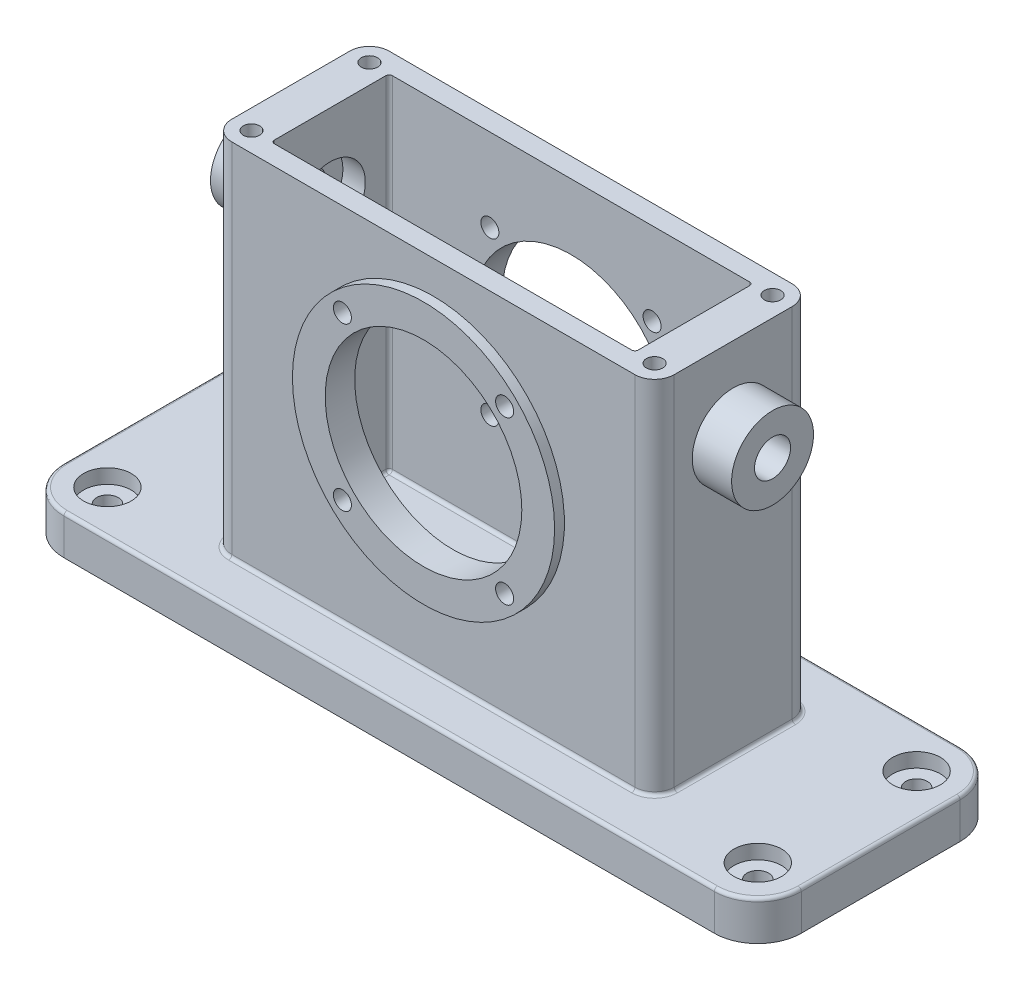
ISO-10303-21;
HEADER;
FILE_DESCRIPTION(('STEP AP214'),'2;1');
FILE_NAME('part.step','',(''),(''),'','','');
FILE_SCHEMA(('AUTOMOTIVE_DESIGN { 1 0 10303 214 1 1 1 1 }'));
ENDSEC;
DATA;
#1=APPLICATION_CONTEXT('core data for automotive mechanical design processes');
#2=APPLICATION_PROTOCOL_DEFINITION('international standard','automotive_design',2000,#1);
#3=PRODUCT_CONTEXT('',#1,'mechanical');
#4=PRODUCT('Part','Part','',(#3));
#5=PRODUCT_RELATED_PRODUCT_CATEGORY('part','',(#4));
#6=PRODUCT_DEFINITION_FORMATION('','',#4);
#7=PRODUCT_DEFINITION_CONTEXT('part definition',#1,'design');
#8=PRODUCT_DEFINITION('design','',#6,#7);
#9=PRODUCT_DEFINITION_SHAPE('','',#8);
#10=(LENGTH_UNIT() NAMED_UNIT(*) SI_UNIT(.MILLI.,.METRE.));
#11=(NAMED_UNIT(*) PLANE_ANGLE_UNIT() SI_UNIT($,.RADIAN.));
#12=(NAMED_UNIT(*) SI_UNIT($,.STERADIAN.) SOLID_ANGLE_UNIT());
#13=UNCERTAINTY_MEASURE_WITH_UNIT(LENGTH_MEASURE(1.E-05),#10,'distance_accuracy_value','');
#14=(GEOMETRIC_REPRESENTATION_CONTEXT(3) GLOBAL_UNCERTAINTY_ASSIGNED_CONTEXT((#13)) GLOBAL_UNIT_ASSIGNED_CONTEXT((#10,
#11,#12)) REPRESENTATION_CONTEXT('',''));
#15=CARTESIAN_POINT('',(0.,0.,0.));
#16=DIRECTION('',(0.,0.,1.));
#17=DIRECTION('',(1.,0.,0.));
#18=AXIS2_PLACEMENT_3D('',#15,#16,#17);
#19=CARTESIAN_POINT('',(0.,122.,24.));
#20=DIRECTION('',(0.,0.,-1.));
#21=DIRECTION('',(-1.,0.,0.));
#22=AXIS2_PLACEMENT_3D('',#19,#20,#21);
#23=PLANE('',#22);
#24=DIRECTION('',(1.,0.,0.));
#25=VECTOR('',#24,1.);
#26=CARTESIAN_POINT('',(0.,122.,24.));
#27=LINE('',#26,#25);
#28=CARTESIAN_POINT('',(-61.5,122.,24.));
#29=VERTEX_POINT('',#28);
#30=CARTESIAN_POINT('',(61.5,122.,24.));
#31=VERTEX_POINT('',#30);
#32=EDGE_CURVE('E510',#29,#31,#27,.T.);
#33=ORIENTED_EDGE('',*,*,#32,.F.);
#34=DIRECTION('',(0.,-1.,0.));
#35=VECTOR('',#34,1.);
#36=CARTESIAN_POINT('',(-61.5,122.,24.));
#37=LINE('',#36,#35);
#38=CARTESIAN_POINT('',(-61.5,13.,24.));
#39=VERTEX_POINT('',#38);
#40=EDGE_CURVE('E381',#39,#29,#37,.F.);
#41=ORIENTED_EDGE('',*,*,#40,.F.);
#42=DIRECTION('',(1.,0.,0.));
#43=VECTOR('',#42,1.);
#44=CARTESIAN_POINT('',(61.5,13.,24.));
#45=LINE('',#44,#43);
#46=CARTESIAN_POINT('',(61.5,13.,24.));
#47=VERTEX_POINT('',#46);
#48=EDGE_CURVE('E609',#39,#47,#45,.T.);
#49=ORIENTED_EDGE('',*,*,#48,.T.);
#50=DIRECTION('',(0.,-1.,0.));
#51=VECTOR('',#50,1.);
#52=CARTESIAN_POINT('',(61.5,122.,24.));
#53=LINE('',#52,#51);
#54=EDGE_CURVE('E589',#47,#31,#53,.F.);
#55=ORIENTED_EDGE('',*,*,#54,.T.);
#56=EDGE_LOOP('',(#33,#41,#49,#55));
#57=FACE_BOUND('',#56,.T.);
#58=CARTESIAN_POINT('',(0.,72.,24.));
#59=DIRECTION('',(0.,0.,-1.));
#60=DIRECTION('',(-1.,0.,0.));
#61=AXIS2_PLACEMENT_3D('',#58,#59,#60);
#62=CIRCLE('',#61,40.);
#63=CARTESIAN_POINT('',(-40.,72.,24.));
#64=VERTEX_POINT('',#63);
#65=EDGE_CURVE('E13',#64,#64,#62,.F.);
#66=ORIENTED_EDGE('',*,*,#65,.F.);
#67=EDGE_LOOP('',(#66));
#68=FACE_BOUND('',#67,.T.);
#69=ADVANCED_FACE('F37',(#57,#68),#23,.F.);
#70=CARTESIAN_POINT('',(67.5,122.,-24.));
#71=DIRECTION('',(-1.,0.,0.));
#72=DIRECTION('',(0.,0.,1.));
#73=AXIS2_PLACEMENT_3D('',#70,#71,#72);
#74=PLANE('',#73);
#75=DIRECTION('',(0.,-1.,0.));
#76=VECTOR('',#75,1.);
#77=CARTESIAN_POINT('',(67.5,122.,18.));
#78=LINE('',#77,#76);
#79=CARTESIAN_POINT('',(67.5,122.,18.));
#80=VERTEX_POINT('',#79);
#81=CARTESIAN_POINT('',(67.5,13.,18.));
#82=VERTEX_POINT('',#81);
#83=EDGE_CURVE('E580',#80,#82,#78,.T.);
#84=ORIENTED_EDGE('',*,*,#83,.T.);
#85=DIRECTION('',(0.,0.,-1.));
#86=VECTOR('',#85,1.);
#87=CARTESIAN_POINT('',(67.5,13.,-18.));
#88=LINE('',#87,#86);
#89=CARTESIAN_POINT('',(67.5,13.,-18.));
#90=VERTEX_POINT('',#89);
#91=EDGE_CURVE('E605',#82,#90,#88,.T.);
#92=ORIENTED_EDGE('',*,*,#91,.T.);
#93=DIRECTION('',(0.,-1.,0.));
#94=VECTOR('',#93,1.);
#95=CARTESIAN_POINT('',(67.5,122.,-18.));
#96=LINE('',#95,#94);
#97=CARTESIAN_POINT('',(67.5,122.,-18.));
#98=VERTEX_POINT('',#97);
#99=EDGE_CURVE('E583',#90,#98,#96,.F.);
#100=ORIENTED_EDGE('',*,*,#99,.T.);
#101=DIRECTION('',(0.,0.,-1.));
#102=VECTOR('',#101,1.);
#103=CARTESIAN_POINT('',(67.5,122.,-24.));
#104=LINE('',#103,#102);
#105=EDGE_CURVE('E513',#80,#98,#104,.T.);
#106=ORIENTED_EDGE('',*,*,#105,.F.);
#107=EDGE_LOOP('',(#84,#92,#100,#106));
#108=FACE_BOUND('',#107,.T.);
#109=CARTESIAN_POINT('',(67.5,97.,0.));
#110=DIRECTION('',(-1.,0.,0.));
#111=DIRECTION('',(0.,0.,1.));
#112=AXIS2_PLACEMENT_3D('',#109,#110,#111);
#113=CIRCLE('',#112,12.5);
#114=CARTESIAN_POINT('',(67.5,97.,12.5));
#115=VERTEX_POINT('',#114);
#116=EDGE_CURVE('E526',#115,#115,#113,.F.);
#117=ORIENTED_EDGE('',*,*,#116,.F.);
#118=EDGE_LOOP('',(#117));
#119=FACE_BOUND('',#118,.T.);
#120=ADVANCED_FACE('F770',(#108,#119),#74,.F.);
#121=CARTESIAN_POINT('',(0.,12.,0.));
#122=DIRECTION('',(0.,-1.,0.));
#123=DIRECTION('',(0.,0.,-1.));
#124=AXIS2_PLACEMENT_3D('',#121,#122,#123);
#125=PLANE('',#124);
#126=CARTESIAN_POINT('',(-61.5,12.,-18.));
#127=DIRECTION('',(0.,1.,0.));
#128=DIRECTION('',(0.,0.,-1.));
#129=AXIS2_PLACEMENT_3D('',#126,#127,#128);
#130=CIRCLE('',#129,7.);
#131=CARTESIAN_POINT('',(-61.5,12.,-25.));
#132=VERTEX_POINT('',#131);
#133=CARTESIAN_POINT('',(-68.5,12.,-18.));
#134=VERTEX_POINT('',#133);
#135=EDGE_CURVE('E390',#132,#134,#130,.T.);
#136=ORIENTED_EDGE('',*,*,#135,.F.);
#137=DIRECTION('',(-1.,0.,0.));
#138=VECTOR('',#137,1.);
#139=CARTESIAN_POINT('',(61.5,12.,-25.));
#140=LINE('',#139,#138);
#141=CARTESIAN_POINT('',(61.5,12.,-25.));
#142=VERTEX_POINT('',#141);
#143=EDGE_CURVE('E601',#132,#142,#140,.F.);
#144=ORIENTED_EDGE('',*,*,#143,.T.);
#145=CARTESIAN_POINT('',(61.5,12.,-18.));
#146=DIRECTION('',(0.,-1.,0.));
#147=DIRECTION('',(0.,0.,-1.));
#148=AXIS2_PLACEMENT_3D('',#145,#146,#147);
#149=CIRCLE('',#148,7.);
#150=CARTESIAN_POINT('',(68.5,12.,-18.));
#151=VERTEX_POINT('',#150);
#152=EDGE_CURVE('E599',#142,#151,#149,.T.);
#153=ORIENTED_EDGE('',*,*,#152,.T.);
#154=DIRECTION('',(0.,0.,-1.));
#155=VECTOR('',#154,1.);
#156=CARTESIAN_POINT('',(68.5,12.,18.));
#157=LINE('',#156,#155);
#158=CARTESIAN_POINT('',(68.5,12.,18.));
#159=VERTEX_POINT('',#158);
#160=EDGE_CURVE('E597',#151,#159,#157,.F.);
#161=ORIENTED_EDGE('',*,*,#160,.T.);
#162=CARTESIAN_POINT('',(61.5,12.,18.));
#163=DIRECTION('',(0.,-1.,0.));
#164=DIRECTION('',(0.,0.,-1.));
#165=AXIS2_PLACEMENT_3D('',#162,#163,#164);
#166=CIRCLE('',#165,7.);
#167=CARTESIAN_POINT('',(61.5,12.,25.));
#168=VERTEX_POINT('',#167);
#169=EDGE_CURVE('E595',#159,#168,#166,.T.);
#170=ORIENTED_EDGE('',*,*,#169,.T.);
#171=DIRECTION('',(1.,0.,0.));
#172=VECTOR('',#171,1.);
#173=CARTESIAN_POINT('',(0.,12.,25.));
#174=LINE('',#173,#172);
#175=CARTESIAN_POINT('',(-61.5,12.,25.));
#176=VERTEX_POINT('',#175);
#177=EDGE_CURVE('E593',#168,#176,#174,.F.);
#178=ORIENTED_EDGE('',*,*,#177,.T.);
#179=CARTESIAN_POINT('',(-61.5,12.,18.));
#180=DIRECTION('',(0.,1.,0.));
#181=DIRECTION('',(0.,0.,-1.));
#182=AXIS2_PLACEMENT_3D('',#179,#180,#181);
#183=CIRCLE('',#182,7.);
#184=CARTESIAN_POINT('',(-68.5,12.,18.));
#185=VERTEX_POINT('',#184);
#186=EDGE_CURVE('E384',#185,#176,#183,.T.);
#187=ORIENTED_EDGE('',*,*,#186,.F.);
#188=DIRECTION('',(0.,0.,-1.));
#189=VECTOR('',#188,1.);
#190=CARTESIAN_POINT('',(-68.5,12.,18.));
#191=LINE('',#190,#189);
#192=EDGE_CURVE('E387',#134,#185,#191,.F.);
#193=ORIENTED_EDGE('',*,*,#192,.F.);
#194=EDGE_LOOP('',(#136,#144,#153,#161,#170,#178,#187,#193));
#195=FACE_BOUND('',#194,.T.);
#196=CARTESIAN_POINT('',(99.225,12.,24.225));
#197=DIRECTION('',(0.,1.,0.));
#198=DIRECTION('',(0.,0.,1.));
#199=AXIS2_PLACEMENT_3D('',#196,#197,#198);
#200=CIRCLE('',#199,7.275);
#201=CARTESIAN_POINT('',(99.225,12.,31.5));
#202=VERTEX_POINT('',#201);
#203=EDGE_CURVE('E441',#202,#202,#200,.T.);
#204=ORIENTED_EDGE('',*,*,#203,.F.);
#205=EDGE_LOOP('',(#204));
#206=FACE_BOUND('',#205,.T.);
#207=CARTESIAN_POINT('',(99.225,12.,-24.225));
#208=DIRECTION('',(0.,1.,0.));
#209=DIRECTION('',(0.,0.,1.));
#210=AXIS2_PLACEMENT_3D('',#207,#208,#209);
#211=CIRCLE('',#210,7.275);
#212=CARTESIAN_POINT('',(99.225,12.,-16.95));
#213=VERTEX_POINT('',#212);
#214=EDGE_CURVE('E463',#213,#213,#211,.T.);
#215=ORIENTED_EDGE('',*,*,#214,.F.);
#216=EDGE_LOOP('',(#215));
#217=FACE_BOUND('',#216,.T.);
#218=DIRECTION('',(-1.,0.,0.));
#219=VECTOR('',#218,1.);
#220=CARTESIAN_POINT('',(0.,12.,-36.5));
#221=LINE('',#220,#219);
#222=CARTESIAN_POINT('',(99.225,12.,-36.5));
#223=VERTEX_POINT('',#222);
#224=CARTESIAN_POINT('',(-99.225,12.,-36.5));
#225=VERTEX_POINT('',#224);
#226=EDGE_CURVE('E553',#223,#225,#221,.T.);
#227=ORIENTED_EDGE('',*,*,#226,.T.);
#228=CARTESIAN_POINT('',(-99.225,12.,-24.225));
#229=DIRECTION('',(0.,1.,0.));
#230=DIRECTION('',(0.,0.,-1.));
#231=AXIS2_PLACEMENT_3D('',#228,#229,#230);
#232=CIRCLE('',#231,12.275);
#233=CARTESIAN_POINT('',(-111.5,12.,-24.225));
#234=VERTEX_POINT('',#233);
#235=EDGE_CURVE('E345',#234,#225,#232,.F.);
#236=ORIENTED_EDGE('',*,*,#235,.F.);
#237=DIRECTION('',(0.,0.,-1.));
#238=VECTOR('',#237,1.);
#239=CARTESIAN_POINT('',(-111.5,12.,0.));
#240=LINE('',#239,#238);
#241=CARTESIAN_POINT('',(-111.5,12.,24.225));
#242=VERTEX_POINT('',#241);
#243=EDGE_CURVE('E342',#242,#234,#240,.T.);
#244=ORIENTED_EDGE('',*,*,#243,.F.);
#245=CARTESIAN_POINT('',(-99.225,12.,24.225));
#246=DIRECTION('',(0.,1.,0.));
#247=DIRECTION('',(0.,0.,-1.));
#248=AXIS2_PLACEMENT_3D('',#245,#246,#247);
#249=CIRCLE('',#248,12.275);
#250=CARTESIAN_POINT('',(-99.225,12.,36.5));
#251=VERTEX_POINT('',#250);
#252=EDGE_CURVE('E339',#251,#242,#249,.F.);
#253=ORIENTED_EDGE('',*,*,#252,.F.);
#254=DIRECTION('',(1.,0.,0.));
#255=VECTOR('',#254,1.);
#256=CARTESIAN_POINT('',(0.,12.,36.5));
#257=LINE('',#256,#255);
#258=CARTESIAN_POINT('',(99.225,12.,36.5));
#259=VERTEX_POINT('',#258);
#260=EDGE_CURVE('E545',#251,#259,#257,.T.);
#261=ORIENTED_EDGE('',*,*,#260,.T.);
#262=CARTESIAN_POINT('',(99.225,12.,24.225));
#263=DIRECTION('',(0.,-1.,0.));
#264=DIRECTION('',(0.,0.,-1.));
#265=AXIS2_PLACEMENT_3D('',#262,#263,#264);
#266=CIRCLE('',#265,12.275);
#267=CARTESIAN_POINT('',(111.5,12.,24.225));
#268=VERTEX_POINT('',#267);
#269=EDGE_CURVE('E547',#259,#268,#266,.F.);
#270=ORIENTED_EDGE('',*,*,#269,.T.);
#271=DIRECTION('',(0.,0.,-1.));
#272=VECTOR('',#271,1.);
#273=CARTESIAN_POINT('',(111.5,12.,0.));
#274=LINE('',#273,#272);
#275=CARTESIAN_POINT('',(111.5,12.,-24.225));
#276=VERTEX_POINT('',#275);
#277=EDGE_CURVE('E549',#268,#276,#274,.T.);
#278=ORIENTED_EDGE('',*,*,#277,.T.);
#279=CARTESIAN_POINT('',(99.225,12.,-24.225));
#280=DIRECTION('',(0.,-1.,0.));
#281=DIRECTION('',(0.,0.,-1.));
#282=AXIS2_PLACEMENT_3D('',#279,#280,#281);
#283=CIRCLE('',#282,12.275);
#284=EDGE_CURVE('E551',#276,#223,#283,.F.);
#285=ORIENTED_EDGE('',*,*,#284,.T.);
#286=EDGE_LOOP('',(#227,#236,#244,#253,#261,#270,#278,#285));
#287=FACE_BOUND('',#286,.T.);
#288=CARTESIAN_POINT('',(-99.225,12.,24.225));
#289=DIRECTION('',(0.,-1.,0.));
#290=DIRECTION('',(0.,0.,1.));
#291=AXIS2_PLACEMENT_3D('',#288,#289,#290);
#292=CIRCLE('',#291,7.275);
#293=CARTESIAN_POINT('',(-99.225,12.,31.5));
#294=VERTEX_POINT('',#293);
#295=EDGE_CURVE('E725',#294,#294,#292,.T.);
#296=ORIENTED_EDGE('',*,*,#295,.T.);
#297=EDGE_LOOP('',(#296));
#298=FACE_BOUND('',#297,.T.);
#299=CARTESIAN_POINT('',(-99.225,12.,-24.225));
#300=DIRECTION('',(0.,-1.,0.));
#301=DIRECTION('',(0.,0.,1.));
#302=AXIS2_PLACEMENT_3D('',#299,#300,#301);
#303=CIRCLE('',#302,7.275);
#304=CARTESIAN_POINT('',(-99.225,12.,-16.95));
#305=VERTEX_POINT('',#304);
#306=EDGE_CURVE('E737',#305,#305,#303,.T.);
#307=ORIENTED_EDGE('',*,*,#306,.T.);
#308=EDGE_LOOP('',(#307));
#309=FACE_BOUND('',#308,.T.);
#310=ADVANCED_FACE('F776',(#195,#206,#217,#287,#298,#309),#125,.F.);
#311=CARTESIAN_POINT('',(112.5,12.,-37.5));
#312=DIRECTION('',(-1.,0.,0.));
#313=DIRECTION('',(0.,0.,1.));
#314=AXIS2_PLACEMENT_3D('',#311,#312,#313);
#315=PLANE('',#314);
#316=DIRECTION('',(0.,-1.,0.));
#317=VECTOR('',#316,1.);
#318=CARTESIAN_POINT('',(112.5,12.,-24.225));
#319=LINE('',#318,#317);
#320=CARTESIAN_POINT('',(112.5,0.,-24.225));
#321=VERTEX_POINT('',#320);
#322=CARTESIAN_POINT('',(112.5,11.,-24.225));
#323=VERTEX_POINT('',#322);
#324=EDGE_CURVE('E539',#321,#323,#319,.F.);
#325=ORIENTED_EDGE('',*,*,#324,.T.);
#326=DIRECTION('',(0.,0.,-1.));
#327=VECTOR('',#326,1.);
#328=CARTESIAN_POINT('',(112.5,11.,-37.5));
#329=LINE('',#328,#327);
#330=CARTESIAN_POINT('',(112.5,11.,24.225));
#331=VERTEX_POINT('',#330);
#332=EDGE_CURVE('E559',#323,#331,#329,.F.);
#333=ORIENTED_EDGE('',*,*,#332,.T.);
#334=DIRECTION('',(0.,-1.,0.));
#335=VECTOR('',#334,1.);
#336=CARTESIAN_POINT('',(112.5,12.,24.225));
#337=LINE('',#336,#335);
#338=CARTESIAN_POINT('',(112.5,0.,24.225));
#339=VERTEX_POINT('',#338);
#340=EDGE_CURVE('E537',#331,#339,#337,.T.);
#341=ORIENTED_EDGE('',*,*,#340,.T.);
#342=DIRECTION('',(0.,0.,-1.));
#343=VECTOR('',#342,1.);
#344=CARTESIAN_POINT('',(112.5,0.,-37.5));
#345=LINE('',#344,#343);
#346=EDGE_CURVE('E518',#339,#321,#345,.T.);
#347=ORIENTED_EDGE('',*,*,#346,.T.);
#348=EDGE_LOOP('',(#325,#333,#341,#347));
#349=FACE_BOUND('',#348,.T.);
#350=ADVANCED_FACE('F781',(#349),#315,.F.);
#351=CARTESIAN_POINT('',(112.5,12.,-37.5));
#352=DIRECTION('',(0.,0.,1.));
#353=DIRECTION('',(1.,0.,0.));
#354=AXIS2_PLACEMENT_3D('',#351,#352,#353);
#355=PLANE('',#354);
#356=DIRECTION('',(-1.,0.,0.));
#357=VECTOR('',#356,1.);
#358=CARTESIAN_POINT('',(112.5,0.,-37.5));
#359=LINE('',#358,#357);
#360=CARTESIAN_POINT('',(99.225,0.,-37.5));
#361=VERTEX_POINT('',#360);
#362=CARTESIAN_POINT('',(-99.225,0.,-37.5));
#363=VERTEX_POINT('',#362);
#364=EDGE_CURVE('E521',#361,#363,#359,.T.);
#365=ORIENTED_EDGE('',*,*,#364,.T.);
#366=DIRECTION('',(0.,-1.,0.));
#367=VECTOR('',#366,1.);
#368=CARTESIAN_POINT('',(-99.225,12.,-37.5));
#369=LINE('',#368,#367);
#370=CARTESIAN_POINT('',(-99.225,11.,-37.5));
#371=VERTEX_POINT('',#370);
#372=EDGE_CURVE('E320',#371,#363,#369,.T.);
#373=ORIENTED_EDGE('',*,*,#372,.F.);
#374=DIRECTION('',(-1.,0.,0.));
#375=VECTOR('',#374,1.);
#376=CARTESIAN_POINT('',(112.5,11.,-37.5));
#377=LINE('',#376,#375);
#378=CARTESIAN_POINT('',(99.225,11.,-37.5));
#379=VERTEX_POINT('',#378);
#380=EDGE_CURVE('E555',#371,#379,#377,.F.);
#381=ORIENTED_EDGE('',*,*,#380,.T.);
#382=DIRECTION('',(0.,-1.,0.));
#383=VECTOR('',#382,1.);
#384=CARTESIAN_POINT('',(99.225,12.,-37.5));
#385=LINE('',#384,#383);
#386=EDGE_CURVE('E529',#379,#361,#385,.T.);
#387=ORIENTED_EDGE('',*,*,#386,.T.);
#388=EDGE_LOOP('',(#365,#373,#381,#387));
#389=FACE_BOUND('',#388,.T.);
#390=ADVANCED_FACE('F764',(#389),#355,.F.);
#391=CARTESIAN_POINT('',(112.5,12.,37.5));
#392=DIRECTION('',(0.,0.,-1.));
#393=DIRECTION('',(-1.,0.,0.));
#394=AXIS2_PLACEMENT_3D('',#391,#392,#393);
#395=PLANE('',#394);
#396=DIRECTION('',(0.,-1.,0.));
#397=VECTOR('',#396,1.);
#398=CARTESIAN_POINT('',(99.225,12.,37.5));
#399=LINE('',#398,#397);
#400=CARTESIAN_POINT('',(99.225,0.,37.5));
#401=VERTEX_POINT('',#400);
#402=CARTESIAN_POINT('',(99.225,11.,37.5));
#403=VERTEX_POINT('',#402);
#404=EDGE_CURVE('E542',#401,#403,#399,.F.);
#405=ORIENTED_EDGE('',*,*,#404,.T.);
#406=DIRECTION('',(1.,0.,0.));
#407=VECTOR('',#406,1.);
#408=CARTESIAN_POINT('',(112.5,11.,37.5));
#409=LINE('',#408,#407);
#410=CARTESIAN_POINT('',(-99.225,11.,37.5));
#411=VERTEX_POINT('',#410);
#412=EDGE_CURVE('E563',#403,#411,#409,.F.);
#413=ORIENTED_EDGE('',*,*,#412,.T.);
#414=DIRECTION('',(0.,-1.,0.));
#415=VECTOR('',#414,1.);
#416=CARTESIAN_POINT('',(-99.225,12.,37.5));
#417=LINE('',#416,#415);
#418=CARTESIAN_POINT('',(-99.225,0.,37.5));
#419=VERTEX_POINT('',#418);
#420=EDGE_CURVE('E336',#419,#411,#417,.F.);
#421=ORIENTED_EDGE('',*,*,#420,.F.);
#422=DIRECTION('',(1.,0.,0.));
#423=VECTOR('',#422,1.);
#424=CARTESIAN_POINT('',(112.5,0.,37.5));
#425=LINE('',#424,#423);
#426=EDGE_CURVE('E523',#419,#401,#425,.T.);
#427=ORIENTED_EDGE('',*,*,#426,.T.);
#428=EDGE_LOOP('',(#405,#413,#421,#427));
#429=FACE_BOUND('',#428,.T.);
#430=ADVANCED_FACE('F754',(#429),#395,.F.);
#431=CARTESIAN_POINT('',(0.,0.,0.));
#432=DIRECTION('',(0.,-1.,0.));
#433=DIRECTION('',(0.,0.,-1.));
#434=AXIS2_PLACEMENT_3D('',#431,#432,#433);
#435=PLANE('',#434);
#436=CARTESIAN_POINT('',(99.225,0.,24.225));
#437=DIRECTION('',(0.,1.,0.));
#438=DIRECTION('',(0.,0.,1.));
#439=AXIS2_PLACEMENT_3D('',#436,#437,#438);
#440=CIRCLE('',#439,3.3);
#441=CARTESIAN_POINT('',(99.225,0.,27.525));
#442=VERTEX_POINT('',#441);
#443=EDGE_CURVE('E460',#442,#442,#440,.T.);
#444=ORIENTED_EDGE('',*,*,#443,.T.);
#445=EDGE_LOOP('',(#444));
#446=FACE_BOUND('',#445,.T.);
#447=CARTESIAN_POINT('',(99.225,0.,-24.225));
#448=DIRECTION('',(0.,1.,0.));
#449=DIRECTION('',(0.,0.,1.));
#450=AXIS2_PLACEMENT_3D('',#447,#448,#449);
#451=CIRCLE('',#450,3.3);
#452=CARTESIAN_POINT('',(99.225,0.,-20.925));
#453=VERTEX_POINT('',#452);
#454=EDGE_CURVE('E472',#453,#453,#451,.T.);
#455=ORIENTED_EDGE('',*,*,#454,.T.);
#456=EDGE_LOOP('',(#455));
#457=FACE_BOUND('',#456,.T.);
#458=ORIENTED_EDGE('',*,*,#364,.F.);
#459=CARTESIAN_POINT('',(99.225,0.,-24.225));
#460=DIRECTION('',(0.,-1.,0.));
#461=DIRECTION('',(0.,0.,-1.));
#462=AXIS2_PLACEMENT_3D('',#459,#460,#461);
#463=CIRCLE('',#462,13.275);
#464=EDGE_CURVE('E535',#361,#321,#463,.T.);
#465=ORIENTED_EDGE('',*,*,#464,.T.);
#466=ORIENTED_EDGE('',*,*,#346,.F.);
#467=CARTESIAN_POINT('',(99.225,0.,24.225));
#468=DIRECTION('',(0.,-1.,0.));
#469=DIRECTION('',(0.,0.,-1.));
#470=AXIS2_PLACEMENT_3D('',#467,#468,#469);
#471=CIRCLE('',#470,13.275);
#472=EDGE_CURVE('E533',#339,#401,#471,.T.);
#473=ORIENTED_EDGE('',*,*,#472,.T.);
#474=ORIENTED_EDGE('',*,*,#426,.F.);
#475=CARTESIAN_POINT('',(-99.225,0.,24.225));
#476=DIRECTION('',(0.,1.,0.));
#477=DIRECTION('',(0.,0.,-1.));
#478=AXIS2_PLACEMENT_3D('',#475,#476,#477);
#479=CIRCLE('',#478,13.275);
#480=CARTESIAN_POINT('',(-112.5,0.,24.225));
#481=VERTEX_POINT('',#480);
#482=EDGE_CURVE('E325',#481,#419,#479,.T.);
#483=ORIENTED_EDGE('',*,*,#482,.F.);
#484=DIRECTION('',(0.,0.,-1.));
#485=VECTOR('',#484,1.);
#486=CARTESIAN_POINT('',(-112.5,0.,-37.5));
#487=LINE('',#486,#485);
#488=CARTESIAN_POINT('',(-112.5,0.,-24.225));
#489=VERTEX_POINT('',#488);
#490=EDGE_CURVE('E314',#481,#489,#487,.T.);
#491=ORIENTED_EDGE('',*,*,#490,.T.);
#492=CARTESIAN_POINT('',(-99.225,0.,-24.225));
#493=DIRECTION('',(0.,1.,0.));
#494=DIRECTION('',(0.,0.,-1.));
#495=AXIS2_PLACEMENT_3D('',#492,#493,#494);
#496=CIRCLE('',#495,13.275);
#497=EDGE_CURVE('E328',#363,#489,#496,.T.);
#498=ORIENTED_EDGE('',*,*,#497,.F.);
#499=EDGE_LOOP('',(#458,#465,#466,#473,#474,#483,#491,#498));
#500=FACE_BOUND('',#499,.T.);
#501=CARTESIAN_POINT('',(-99.225,0.,24.225));
#502=DIRECTION('',(0.,-1.,0.));
#503=DIRECTION('',(0.,0.,1.));
#504=AXIS2_PLACEMENT_3D('',#501,#502,#503);
#505=CIRCLE('',#504,3.3);
#506=CARTESIAN_POINT('',(-99.225,0.,27.525));
#507=VERTEX_POINT('',#506);
#508=EDGE_CURVE('E734',#507,#507,#505,.T.);
#509=ORIENTED_EDGE('',*,*,#508,.F.);
#510=EDGE_LOOP('',(#509));
#511=FACE_BOUND('',#510,.T.);
#512=CARTESIAN_POINT('',(-99.225,0.,-24.225));
#513=DIRECTION('',(0.,-1.,0.));
#514=DIRECTION('',(0.,0.,1.));
#515=AXIS2_PLACEMENT_3D('',#512,#513,#514);
#516=CIRCLE('',#515,3.3);
#517=CARTESIAN_POINT('',(-99.225,0.,-20.925));
#518=VERTEX_POINT('',#517);
#519=EDGE_CURVE('E287',#518,#518,#516,.T.);
#520=ORIENTED_EDGE('',*,*,#519,.F.);
#521=EDGE_LOOP('',(#520));
#522=FACE_BOUND('',#521,.T.);
#523=ADVANCED_FACE('F751',(#446,#457,#500,#511,#522),#435,.T.);
#524=CARTESIAN_POINT('',(0.,122.,-24.));
#525=DIRECTION('',(0.,0.,1.));
#526=DIRECTION('',(1.,0.,0.));
#527=AXIS2_PLACEMENT_3D('',#524,#525,#526);
#528=PLANE('',#527);
#529=CARTESIAN_POINT('',(0.,72.,-24.));
#530=DIRECTION('',(0.,0.,1.));
#531=DIRECTION('',(1.,0.,0.));
#532=AXIS2_PLACEMENT_3D('',#529,#530,#531);
#533=CIRCLE('',#532,40.);
#534=CARTESIAN_POINT('',(40.,72.,-24.));
#535=VERTEX_POINT('',#534);
#536=EDGE_CURVE('E716',#535,#535,#533,.T.);
#537=ORIENTED_EDGE('',*,*,#536,.T.);
#538=EDGE_LOOP('',(#537));
#539=FACE_BOUND('',#538,.T.);
#540=DIRECTION('',(0.,-1.,0.));
#541=VECTOR('',#540,1.);
#542=CARTESIAN_POINT('',(61.5,122.,-24.));
#543=LINE('',#542,#541);
#544=CARTESIAN_POINT('',(61.5,122.,-24.));
#545=VERTEX_POINT('',#544);
#546=CARTESIAN_POINT('',(61.5,13.,-24.));
#547=VERTEX_POINT('',#546);
#548=EDGE_CURVE('E565',#545,#547,#543,.T.);
#549=ORIENTED_EDGE('',*,*,#548,.T.);
#550=DIRECTION('',(-1.,0.,0.));
#551=VECTOR('',#550,1.);
#552=CARTESIAN_POINT('',(0.,13.,-24.));
#553=LINE('',#552,#551);
#554=CARTESIAN_POINT('',(-61.5,13.,-24.));
#555=VERTEX_POINT('',#554);
#556=EDGE_CURVE('E591',#547,#555,#553,.T.);
#557=ORIENTED_EDGE('',*,*,#556,.T.);
#558=DIRECTION('',(0.,-1.,0.));
#559=VECTOR('',#558,1.);
#560=CARTESIAN_POINT('',(-61.5,122.,-24.));
#561=LINE('',#560,#559);
#562=CARTESIAN_POINT('',(-61.5,122.,-24.));
#563=VERTEX_POINT('',#562);
#564=EDGE_CURVE('E357',#563,#555,#561,.T.);
#565=ORIENTED_EDGE('',*,*,#564,.F.);
#566=DIRECTION('',(-1.,0.,0.));
#567=VECTOR('',#566,1.);
#568=CARTESIAN_POINT('',(0.,122.,-24.));
#569=LINE('',#568,#567);
#570=EDGE_CURVE('E516',#545,#563,#569,.T.);
#571=ORIENTED_EDGE('',*,*,#570,.F.);
#572=EDGE_LOOP('',(#549,#557,#565,#571));
#573=FACE_BOUND('',#572,.T.);
#574=ADVANCED_FACE('F753',(#539,#573),#528,.F.);
#575=CARTESIAN_POINT('',(0.,122.,0.));
#576=DIRECTION('',(0.,1.,0.));
#577=DIRECTION('',(0.,0.,1.));
#578=AXIS2_PLACEMENT_3D('',#575,#576,#577);
#579=PLANE('',#578);
#580=CARTESIAN_POINT('',(-61.5,122.,18.));
#581=DIRECTION('',(0.,-1.,0.));
#582=DIRECTION('',(0.,0.,1.));
#583=AXIS2_PLACEMENT_3D('',#580,#581,#582);
#584=CIRCLE('',#583,6.);
#585=CARTESIAN_POINT('',(-67.5,122.,18.));
#586=VERTEX_POINT('',#585);
#587=EDGE_CURVE('E376',#29,#586,#584,.T.);
#588=ORIENTED_EDGE('',*,*,#587,.F.);
#589=ORIENTED_EDGE('',*,*,#32,.T.);
#590=CARTESIAN_POINT('',(61.5,122.,18.));
#591=DIRECTION('',(0.,1.,0.));
#592=DIRECTION('',(0.,0.,1.));
#593=AXIS2_PLACEMENT_3D('',#590,#591,#592);
#594=CIRCLE('',#593,6.);
#595=EDGE_CURVE('E585',#31,#80,#594,.T.);
#596=ORIENTED_EDGE('',*,*,#595,.T.);
#597=ORIENTED_EDGE('',*,*,#105,.T.);
#598=CARTESIAN_POINT('',(61.5,122.,-18.));
#599=DIRECTION('',(0.,1.,0.));
#600=DIRECTION('',(0.,0.,1.));
#601=AXIS2_PLACEMENT_3D('',#598,#599,#600);
#602=CIRCLE('',#601,6.);
#603=EDGE_CURVE('E587',#98,#545,#602,.T.);
#604=ORIENTED_EDGE('',*,*,#603,.T.);
#605=ORIENTED_EDGE('',*,*,#570,.T.);
#606=CARTESIAN_POINT('',(-61.5,122.,-18.));
#607=DIRECTION('',(0.,-1.,0.));
#608=DIRECTION('',(0.,0.,1.));
#609=AXIS2_PLACEMENT_3D('',#606,#607,#608);
#610=CIRCLE('',#609,6.);
#611=CARTESIAN_POINT('',(-67.5,122.,-18.));
#612=VERTEX_POINT('',#611);
#613=EDGE_CURVE('E378',#612,#563,#610,.T.);
#614=ORIENTED_EDGE('',*,*,#613,.F.);
#615=DIRECTION('',(0.,0.,-1.));
#616=VECTOR('',#615,1.);
#617=CARTESIAN_POINT('',(-67.5,122.,-24.));
#618=LINE('',#617,#616);
#619=EDGE_CURVE('E311',#586,#612,#618,.T.);
#620=ORIENTED_EDGE('',*,*,#619,.F.);
#621=EDGE_LOOP('',(#588,#589,#596,#597,#604,#605,#614,#620));
#622=FACE_BOUND('',#621,.T.);
#623=CARTESIAN_POINT('',(61.5,122.,18.));
#624=DIRECTION('',(0.,1.,0.));
#625=DIRECTION('',(0.,0.,1.));
#626=AXIS2_PLACEMENT_3D('',#623,#624,#625);
#627=CIRCLE('',#626,2.5);
#628=CARTESIAN_POINT('',(61.5,122.,20.5));
#629=VERTEX_POINT('',#628);
#630=EDGE_CURVE('E475',#629,#629,#627,.T.);
#631=ORIENTED_EDGE('',*,*,#630,.F.);
#632=EDGE_LOOP('',(#631));
#633=FACE_BOUND('',#632,.T.);
#634=CARTESIAN_POINT('',(61.5,122.,-18.));
#635=DIRECTION('',(0.,1.,0.));
#636=DIRECTION('',(0.,0.,1.));
#637=AXIS2_PLACEMENT_3D('',#634,#635,#636);
#638=CIRCLE('',#637,2.5);
#639=CARTESIAN_POINT('',(61.5,122.,-15.5));
#640=VERTEX_POINT('',#639);
#641=EDGE_CURVE('E481',#640,#640,#638,.T.);
#642=ORIENTED_EDGE('',*,*,#641,.F.);
#643=EDGE_LOOP('',(#642));
#644=FACE_BOUND('',#643,.T.);
#645=DIRECTION('',(1.,0.,0.));
#646=VECTOR('',#645,1.);
#647=CARTESIAN_POINT('',(0.,122.,18.));
#648=LINE('',#647,#646);
#649=CARTESIAN_POINT('',(-54.5,122.,18.));
#650=VERTEX_POINT('',#649);
#651=CARTESIAN_POINT('',(54.5,122.,18.));
#652=VERTEX_POINT('',#651);
#653=EDGE_CURVE('E505',#650,#652,#648,.T.);
#654=ORIENTED_EDGE('',*,*,#653,.F.);
#655=CARTESIAN_POINT('',(-54.5,122.,17.));
#656=DIRECTION('',(0.,-1.,0.));
#657=DIRECTION('',(0.,0.,1.));
#658=AXIS2_PLACEMENT_3D('',#655,#656,#657);
#659=CIRCLE('',#658,1.);
#660=CARTESIAN_POINT('',(-55.5,122.,17.));
#661=VERTEX_POINT('',#660);
#662=EDGE_CURVE('E423',#661,#650,#659,.F.);
#663=ORIENTED_EDGE('',*,*,#662,.F.);
#664=DIRECTION('',(0.,0.,-1.));
#665=VECTOR('',#664,1.);
#666=CARTESIAN_POINT('',(-55.5,122.,18.));
#667=LINE('',#666,#665);
#668=CARTESIAN_POINT('',(-55.5,122.,-17.));
#669=VERTEX_POINT('',#668);
#670=EDGE_CURVE('E305',#661,#669,#667,.T.);
#671=ORIENTED_EDGE('',*,*,#670,.T.);
#672=CARTESIAN_POINT('',(-54.5,122.,-17.));
#673=DIRECTION('',(0.,-1.,0.));
#674=DIRECTION('',(0.,0.,1.));
#675=AXIS2_PLACEMENT_3D('',#672,#673,#674);
#676=CIRCLE('',#675,1.);
#677=CARTESIAN_POINT('',(-54.5,122.,-18.));
#678=VERTEX_POINT('',#677);
#679=EDGE_CURVE('E426',#678,#669,#676,.F.);
#680=ORIENTED_EDGE('',*,*,#679,.F.);
#681=DIRECTION('',(-1.,0.,0.));
#682=VECTOR('',#681,1.);
#683=CARTESIAN_POINT('',(0.,122.,-18.));
#684=LINE('',#683,#682);
#685=CARTESIAN_POINT('',(54.5,122.,-18.));
#686=VERTEX_POINT('',#685);
#687=EDGE_CURVE('E499',#686,#678,#684,.T.);
#688=ORIENTED_EDGE('',*,*,#687,.F.);
#689=CARTESIAN_POINT('',(54.5,122.,-17.));
#690=DIRECTION('',(0.,1.,0.));
#691=DIRECTION('',(0.,0.,1.));
#692=AXIS2_PLACEMENT_3D('',#689,#690,#691);
#693=CIRCLE('',#692,1.);
#694=CARTESIAN_POINT('',(55.5,122.,-17.));
#695=VERTEX_POINT('',#694);
#696=EDGE_CURVE('E634',#686,#695,#693,.F.);
#697=ORIENTED_EDGE('',*,*,#696,.T.);
#698=DIRECTION('',(0.,0.,-1.));
#699=VECTOR('',#698,1.);
#700=CARTESIAN_POINT('',(55.5,122.,18.));
#701=LINE('',#700,#699);
#702=CARTESIAN_POINT('',(55.5,122.,17.));
#703=VERTEX_POINT('',#702);
#704=EDGE_CURVE('E502',#703,#695,#701,.T.);
#705=ORIENTED_EDGE('',*,*,#704,.F.);
#706=CARTESIAN_POINT('',(54.5,122.,17.));
#707=DIRECTION('',(0.,1.,0.));
#708=DIRECTION('',(0.,0.,1.));
#709=AXIS2_PLACEMENT_3D('',#706,#707,#708);
#710=CIRCLE('',#709,1.);
#711=EDGE_CURVE('E632',#703,#652,#710,.F.);
#712=ORIENTED_EDGE('',*,*,#711,.T.);
#713=EDGE_LOOP('',(#654,#663,#671,#680,#688,#697,#705,#712));
#714=FACE_BOUND('',#713,.T.);
#715=CARTESIAN_POINT('',(-61.5,122.,18.));
#716=DIRECTION('',(0.,-1.,0.));
#717=DIRECTION('',(0.,0.,1.));
#718=AXIS2_PLACEMENT_3D('',#715,#716,#717);
#719=CIRCLE('',#718,2.5);
#720=CARTESIAN_POINT('',(-61.5,122.,20.5));
#721=VERTEX_POINT('',#720);
#722=EDGE_CURVE('E281',#721,#721,#719,.T.);
#723=ORIENTED_EDGE('',*,*,#722,.T.);
#724=EDGE_LOOP('',(#723));
#725=FACE_BOUND('',#724,.T.);
#726=CARTESIAN_POINT('',(-61.5,122.,-18.));
#727=DIRECTION('',(0.,-1.,0.));
#728=DIRECTION('',(0.,0.,1.));
#729=AXIS2_PLACEMENT_3D('',#726,#727,#728);
#730=CIRCLE('',#729,2.5);
#731=CARTESIAN_POINT('',(-61.5,122.,-15.5));
#732=VERTEX_POINT('',#731);
#733=EDGE_CURVE('E280',#732,#732,#730,.T.);
#734=ORIENTED_EDGE('',*,*,#733,.T.);
#735=EDGE_LOOP('',(#734));
#736=FACE_BOUND('',#735,.T.);
#737=ADVANCED_FACE('F761',(#622,#633,#644,#714,#725,#736),#579,.T.);
#738=CARTESIAN_POINT('',(79.5,97.,0.));
#739=DIRECTION('',(-1.,0.,0.));
#740=DIRECTION('',(0.,0.,1.));
#741=AXIS2_PLACEMENT_3D('',#738,#739,#740);
#742=CYLINDRICAL_SURFACE('',#741,12.5);
#743=CARTESIAN_POINT('',(79.5,97.,0.));
#744=DIRECTION('',(1.,0.,0.));
#745=DIRECTION('',(0.,0.,-1.));
#746=AXIS2_PLACEMENT_3D('',#743,#744,#745);
#747=CIRCLE('',#746,12.5);
#748=CARTESIAN_POINT('',(79.5,97.,-12.5));
#749=VERTEX_POINT('',#748);
#750=EDGE_CURVE('E501',#749,#749,#747,.T.);
#751=ORIENTED_EDGE('',*,*,#750,.F.);
#752=EDGE_LOOP('',(#751));
#753=FACE_BOUND('',#752,.T.);
#754=ORIENTED_EDGE('',*,*,#116,.T.);
#755=EDGE_LOOP('',(#754));
#756=FACE_BOUND('',#755,.T.);
#757=ADVANCED_FACE('F996',(#753,#756),#742,.T.);
#758=CARTESIAN_POINT('',(79.5,97.,0.));
#759=DIRECTION('',(1.,0.,0.));
#760=DIRECTION('',(0.,0.,-1.));
#761=AXIS2_PLACEMENT_3D('',#758,#759,#760);
#762=PLANE('',#761);
#763=CARTESIAN_POINT('',(79.5,97.,0.));
#764=DIRECTION('',(1.,0.,0.));
#765=DIRECTION('',(0.,0.,-1.));
#766=AXIS2_PLACEMENT_3D('',#763,#764,#765);
#767=CIRCLE('',#766,5.5);
#768=CARTESIAN_POINT('',(79.5,97.,-5.5));
#769=VERTEX_POINT('',#768);
#770=EDGE_CURVE('E498',#769,#769,#767,.T.);
#771=ORIENTED_EDGE('',*,*,#770,.F.);
#772=EDGE_LOOP('',(#771));
#773=FACE_BOUND('',#772,.T.);
#774=ORIENTED_EDGE('',*,*,#750,.T.);
#775=EDGE_LOOP('',(#774));
#776=FACE_BOUND('',#775,.T.);
#777=ADVANCED_FACE('F992',(#773,#776),#762,.T.);
#778=CARTESIAN_POINT('',(0.,17.,0.));
#779=DIRECTION('',(0.,-1.,0.));
#780=DIRECTION('',(0.,0.,-1.));
#781=AXIS2_PLACEMENT_3D('',#778,#779,#780);
#782=PLANE('',#781);
#783=DIRECTION('',(-1.,0.,0.));
#784=VECTOR('',#783,1.);
#785=CARTESIAN_POINT('',(0.,17.,-17.));
#786=LINE('',#785,#784);
#787=CARTESIAN_POINT('',(54.5,17.,-17.));
#788=VERTEX_POINT('',#787);
#789=CARTESIAN_POINT('',(-54.5,17.,-17.));
#790=VERTEX_POINT('',#789);
#791=EDGE_CURVE('E636',#788,#790,#786,.T.);
#792=ORIENTED_EDGE('',*,*,#791,.T.);
#793=DIRECTION('',(0.,0.,-1.));
#794=VECTOR('',#793,1.);
#795=CARTESIAN_POINT('',(-54.5,17.,-17.));
#796=LINE('',#795,#794);
#797=CARTESIAN_POINT('',(-54.5,17.,17.));
#798=VERTEX_POINT('',#797);
#799=EDGE_CURVE('E429',#798,#790,#796,.T.);
#800=ORIENTED_EDGE('',*,*,#799,.F.);
#801=DIRECTION('',(1.,0.,0.));
#802=VECTOR('',#801,1.);
#803=CARTESIAN_POINT('',(54.5,17.,17.));
#804=LINE('',#803,#802);
#805=CARTESIAN_POINT('',(54.5,17.,17.));
#806=VERTEX_POINT('',#805);
#807=EDGE_CURVE('E640',#798,#806,#804,.T.);
#808=ORIENTED_EDGE('',*,*,#807,.T.);
#809=DIRECTION('',(0.,0.,-1.));
#810=VECTOR('',#809,1.);
#811=CARTESIAN_POINT('',(54.5,17.,-17.));
#812=LINE('',#811,#810);
#813=EDGE_CURVE('E638',#806,#788,#812,.T.);
#814=ORIENTED_EDGE('',*,*,#813,.T.);
#815=EDGE_LOOP('',(#792,#800,#808,#814));
#816=FACE_BOUND('',#815,.T.);
#817=ADVANCED_FACE('F988',(#816),#782,.F.);
#818=CARTESIAN_POINT('',(0.,-54.1532312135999,18.));
#819=DIRECTION('',(0.,0.,1.));
#820=DIRECTION('',(1.,0.,0.));
#821=AXIS2_PLACEMENT_3D('',#818,#819,#820);
#822=PLANE('',#821);
#823=CARTESIAN_POINT('',(24.7487373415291,96.7487373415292,18.));
#824=DIRECTION('',(0.,0.,1.));
#825=DIRECTION('',(1.,0.,0.));
#826=AXIS2_PLACEMENT_3D('',#823,#824,#825);
#827=CIRCLE('',#826,2.74999999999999);
#828=CARTESIAN_POINT('',(27.4987373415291,96.7487373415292,18.));
#829=VERTEX_POINT('',#828);
#830=EDGE_CURVE('E689',#829,#829,#827,.T.);
#831=ORIENTED_EDGE('',*,*,#830,.T.);
#832=EDGE_LOOP('',(#831));
#833=FACE_BOUND('',#832,.T.);
#834=CARTESIAN_POINT('',(24.7487373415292,47.2512626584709,18.));
#835=DIRECTION('',(0.,0.,1.));
#836=DIRECTION('',(1.,0.,0.));
#837=AXIS2_PLACEMENT_3D('',#834,#835,#836);
#838=CIRCLE('',#837,2.74999999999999);
#839=CARTESIAN_POINT('',(27.4987373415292,47.2512626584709,18.));
#840=VERTEX_POINT('',#839);
#841=EDGE_CURVE('E681',#840,#840,#838,.T.);
#842=ORIENTED_EDGE('',*,*,#841,.T.);
#843=EDGE_LOOP('',(#842));
#844=FACE_BOUND('',#843,.T.);
#845=CARTESIAN_POINT('',(-24.7487373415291,47.2512626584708,18.));
#846=DIRECTION('',(0.,0.,1.));
#847=DIRECTION('',(1.,0.,0.));
#848=AXIS2_PLACEMENT_3D('',#845,#846,#847);
#849=CIRCLE('',#848,2.74999999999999);
#850=CARTESIAN_POINT('',(-21.9987373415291,47.2512626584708,18.));
#851=VERTEX_POINT('',#850);
#852=EDGE_CURVE('E699',#851,#851,#849,.T.);
#853=ORIENTED_EDGE('',*,*,#852,.T.);
#854=EDGE_LOOP('',(#853));
#855=FACE_BOUND('',#854,.T.);
#856=CARTESIAN_POINT('',(-24.7487373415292,96.7487373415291,18.));
#857=DIRECTION('',(0.,0.,1.));
#858=DIRECTION('',(1.,0.,0.));
#859=AXIS2_PLACEMENT_3D('',#856,#857,#858);
#860=CIRCLE('',#859,2.74999999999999);
#861=CARTESIAN_POINT('',(-21.9987373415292,96.7487373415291,18.));
#862=VERTEX_POINT('',#861);
#863=EDGE_CURVE('E665',#862,#862,#860,.T.);
#864=ORIENTED_EDGE('',*,*,#863,.T.);
#865=EDGE_LOOP('',(#864));
#866=FACE_BOUND('',#865,.T.);
#867=CARTESIAN_POINT('',(0.,72.,18.));
#868=DIRECTION('',(0.,0.,1.));
#869=DIRECTION('',(1.,0.,0.));
#870=AXIS2_PLACEMENT_3D('',#867,#868,#869);
#871=CIRCLE('',#870,30.);
#872=CARTESIAN_POINT('',(30.,72.,18.));
#873=VERTEX_POINT('',#872);
#874=EDGE_CURVE('E713',#873,#873,#871,.T.);
#875=ORIENTED_EDGE('',*,*,#874,.T.);
#876=EDGE_LOOP('',(#875));
#877=FACE_BOUND('',#876,.T.);
#878=DIRECTION('',(0.,1.,0.));
#879=VECTOR('',#878,1.);
#880=CARTESIAN_POINT('',(54.5,17.,18.));
#881=LINE('',#880,#879);
#882=CARTESIAN_POINT('',(54.5,18.,18.));
#883=VERTEX_POINT('',#882);
#884=EDGE_CURVE('E627',#652,#883,#881,.F.);
#885=ORIENTED_EDGE('',*,*,#884,.T.);
#886=DIRECTION('',(1.,0.,0.));
#887=VECTOR('',#886,1.);
#888=CARTESIAN_POINT('',(0.,18.,18.));
#889=LINE('',#888,#887);
#890=CARTESIAN_POINT('',(-54.5,18.,18.));
#891=VERTEX_POINT('',#890);
#892=EDGE_CURVE('E643',#883,#891,#889,.F.);
#893=ORIENTED_EDGE('',*,*,#892,.T.);
#894=DIRECTION('',(0.,1.,0.));
#895=VECTOR('',#894,1.);
#896=CARTESIAN_POINT('',(-54.5,17.,18.));
#897=LINE('',#896,#895);
#898=EDGE_CURVE('E417',#650,#891,#897,.F.);
#899=ORIENTED_EDGE('',*,*,#898,.F.);
#900=ORIENTED_EDGE('',*,*,#653,.T.);
#901=EDGE_LOOP('',(#885,#893,#899,#900));
#902=FACE_BOUND('',#901,.T.);
#903=ADVANCED_FACE('F984',(#833,#844,#855,#866,#877,#902),#822,.F.);
#904=CARTESIAN_POINT('',(55.5,-54.1532312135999,18.));
#905=DIRECTION('',(1.,0.,0.));
#906=DIRECTION('',(0.,0.,-1.));
#907=AXIS2_PLACEMENT_3D('',#904,#905,#906);
#908=PLANE('',#907);
#909=CARTESIAN_POINT('',(55.5,97.,0.));
#910=DIRECTION('',(-1.,0.,0.));
#911=DIRECTION('',(0.,0.,1.));
#912=AXIS2_PLACEMENT_3D('',#909,#910,#911);
#913=CIRCLE('',#912,10.74);
#914=CARTESIAN_POINT('',(55.5,97.,10.74));
#915=VERTEX_POINT('',#914);
#916=EDGE_CURVE('E488',#915,#915,#913,.T.);
#917=ORIENTED_EDGE('',*,*,#916,.F.);
#918=EDGE_LOOP('',(#917));
#919=FACE_BOUND('',#918,.T.);
#920=DIRECTION('',(0.,1.,0.));
#921=VECTOR('',#920,1.);
#922=CARTESIAN_POINT('',(55.5,17.,-17.));
#923=LINE('',#922,#921);
#924=CARTESIAN_POINT('',(55.5,18.,-17.));
#925=VERTEX_POINT('',#924);
#926=EDGE_CURVE('E611',#695,#925,#923,.F.);
#927=ORIENTED_EDGE('',*,*,#926,.T.);
#928=DIRECTION('',(0.,0.,-1.));
#929=VECTOR('',#928,1.);
#930=CARTESIAN_POINT('',(55.5,18.,17.));
#931=LINE('',#930,#929);
#932=CARTESIAN_POINT('',(55.5,18.,17.));
#933=VERTEX_POINT('',#932);
#934=EDGE_CURVE('E647',#925,#933,#931,.F.);
#935=ORIENTED_EDGE('',*,*,#934,.T.);
#936=DIRECTION('',(0.,1.,0.));
#937=VECTOR('',#936,1.);
#938=CARTESIAN_POINT('',(55.5,122.,17.));
#939=LINE('',#938,#937);
#940=EDGE_CURVE('E625',#933,#703,#939,.T.);
#941=ORIENTED_EDGE('',*,*,#940,.T.);
#942=ORIENTED_EDGE('',*,*,#704,.T.);
#943=EDGE_LOOP('',(#927,#935,#941,#942));
#944=FACE_BOUND('',#943,.T.);
#945=ADVANCED_FACE('F980',(#919,#944),#908,.F.);
#946=CARTESIAN_POINT('',(0.,-54.1532312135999,-18.));
#947=DIRECTION('',(0.,0.,-1.));
#948=DIRECTION('',(-1.,0.,0.));
#949=AXIS2_PLACEMENT_3D('',#946,#947,#948);
#950=PLANE('',#949);
#951=CARTESIAN_POINT('',(24.7487373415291,96.7487373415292,-18.));
#952=DIRECTION('',(0.,0.,-1.));
#953=DIRECTION('',(-1.,0.,0.));
#954=AXIS2_PLACEMENT_3D('',#951,#952,#953);
#955=CIRCLE('',#954,2.74999999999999);
#956=CARTESIAN_POINT('',(21.9987373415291,96.7487373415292,-18.));
#957=VERTEX_POINT('',#956);
#958=EDGE_CURVE('E684',#957,#957,#955,.T.);
#959=ORIENTED_EDGE('',*,*,#958,.T.);
#960=EDGE_LOOP('',(#959));
#961=FACE_BOUND('',#960,.T.);
#962=CARTESIAN_POINT('',(24.7487373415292,47.2512626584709,-18.));
#963=DIRECTION('',(0.,0.,-1.));
#964=DIRECTION('',(-1.,0.,0.));
#965=AXIS2_PLACEMENT_3D('',#962,#963,#964);
#966=CIRCLE('',#965,2.74999999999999);
#967=CARTESIAN_POINT('',(21.9987373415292,47.2512626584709,-18.));
#968=VERTEX_POINT('',#967);
#969=EDGE_CURVE('E676',#968,#968,#966,.T.);
#970=ORIENTED_EDGE('',*,*,#969,.T.);
#971=EDGE_LOOP('',(#970));
#972=FACE_BOUND('',#971,.T.);
#973=CARTESIAN_POINT('',(-24.7487373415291,47.2512626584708,-18.));
#974=DIRECTION('',(0.,0.,-1.));
#975=DIRECTION('',(-1.,0.,0.));
#976=AXIS2_PLACEMENT_3D('',#973,#974,#975);
#977=CIRCLE('',#976,2.74999999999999);
#978=CARTESIAN_POINT('',(-27.4987373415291,47.2512626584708,-18.));
#979=VERTEX_POINT('',#978);
#980=EDGE_CURVE('E672',#979,#979,#977,.T.);
#981=ORIENTED_EDGE('',*,*,#980,.T.);
#982=EDGE_LOOP('',(#981));
#983=FACE_BOUND('',#982,.T.);
#984=CARTESIAN_POINT('',(-24.7487373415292,96.7487373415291,-18.));
#985=DIRECTION('',(0.,0.,-1.));
#986=DIRECTION('',(-1.,0.,0.));
#987=AXIS2_PLACEMENT_3D('',#984,#985,#986);
#988=CIRCLE('',#987,2.74999999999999);
#989=CARTESIAN_POINT('',(-27.4987373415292,96.7487373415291,-18.));
#990=VERTEX_POINT('',#989);
#991=EDGE_CURVE('E668',#990,#990,#988,.T.);
#992=ORIENTED_EDGE('',*,*,#991,.T.);
#993=EDGE_LOOP('',(#992));
#994=FACE_BOUND('',#993,.T.);
#995=CARTESIAN_POINT('',(0.,72.,-18.));
#996=DIRECTION('',(0.,0.,-1.));
#997=DIRECTION('',(-1.,0.,0.));
#998=AXIS2_PLACEMENT_3D('',#995,#996,#997);
#999=CIRCLE('',#998,30.);
#1000=CARTESIAN_POINT('',(-30.,72.,-18.));
#1001=VERTEX_POINT('',#1000);
#1002=EDGE_CURVE('E663',#1001,#1001,#999,.T.);
#1003=ORIENTED_EDGE('',*,*,#1002,.T.);
#1004=EDGE_LOOP('',(#1003));
#1005=FACE_BOUND('',#1004,.T.);
#1006=ORIENTED_EDGE('',*,*,#687,.T.);
#1007=DIRECTION('',(0.,1.,0.));
#1008=VECTOR('',#1007,1.);
#1009=CARTESIAN_POINT('',(-54.5,122.,-18.));
#1010=LINE('',#1009,#1008);
#1011=CARTESIAN_POINT('',(-54.5,18.,-18.));
#1012=VERTEX_POINT('',#1011);
#1013=EDGE_CURVE('E420',#1012,#678,#1010,.T.);
#1014=ORIENTED_EDGE('',*,*,#1013,.F.);
#1015=DIRECTION('',(-1.,0.,0.));
#1016=VECTOR('',#1015,1.);
#1017=CARTESIAN_POINT('',(54.5,18.,-18.));
#1018=LINE('',#1017,#1016);
#1019=CARTESIAN_POINT('',(54.5,18.,-18.));
#1020=VERTEX_POINT('',#1019);
#1021=EDGE_CURVE('E46',#1012,#1020,#1018,.F.);
#1022=ORIENTED_EDGE('',*,*,#1021,.T.);
#1023=DIRECTION('',(0.,1.,0.));
#1024=VECTOR('',#1023,1.);
#1025=CARTESIAN_POINT('',(54.5,122.,-18.));
#1026=LINE('',#1025,#1024);
#1027=EDGE_CURVE('E630',#1020,#686,#1026,.T.);
#1028=ORIENTED_EDGE('',*,*,#1027,.T.);
#1029=EDGE_LOOP('',(#1006,#1014,#1022,#1028));
#1030=FACE_BOUND('',#1029,.T.);
#1031=ADVANCED_FACE('F976',(#961,#972,#983,#994,#1005,#1030),#950,.F.);
#1032=CARTESIAN_POINT('',(55.5,97.,0.));
#1033=DIRECTION('',(-1.,0.,0.));
#1034=DIRECTION('',(0.,0.,1.));
#1035=AXIS2_PLACEMENT_3D('',#1032,#1033,#1034);
#1036=CYLINDRICAL_SURFACE('',#1035,5.5);
#1037=ORIENTED_EDGE('',*,*,#770,.T.);
#1038=EDGE_LOOP('',(#1037));
#1039=FACE_BOUND('',#1038,.T.);
#1040=CARTESIAN_POINT('',(62.35,97.,0.));
#1041=DIRECTION('',(-1.,0.,0.));
#1042=DIRECTION('',(0.,0.,1.));
#1043=AXIS2_PLACEMENT_3D('',#1040,#1041,#1042);
#1044=CIRCLE('',#1043,5.50000000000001);
#1045=CARTESIAN_POINT('',(62.35,97.,5.50000000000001));
#1046=VERTEX_POINT('',#1045);
#1047=EDGE_CURVE('E495',#1046,#1046,#1044,.T.);
#1048=ORIENTED_EDGE('',*,*,#1047,.T.);
#1049=EDGE_LOOP('',(#1048));
#1050=FACE_BOUND('',#1049,.T.);
#1051=ADVANCED_FACE('F972',(#1039,#1050),#1036,.F.);
#1052=CARTESIAN_POINT('',(62.35,102.5,0.));
#1053=DIRECTION('',(1.,0.,0.));
#1054=DIRECTION('',(0.,0.,-1.));
#1055=AXIS2_PLACEMENT_3D('',#1052,#1053,#1054);
#1056=PLANE('',#1055);
#1057=ORIENTED_EDGE('',*,*,#1047,.F.);
#1058=EDGE_LOOP('',(#1057));
#1059=FACE_BOUND('',#1058,.T.);
#1060=CARTESIAN_POINT('',(62.35,97.,0.));
#1061=DIRECTION('',(-1.,0.,0.));
#1062=DIRECTION('',(0.,0.,1.));
#1063=AXIS2_PLACEMENT_3D('',#1060,#1061,#1062);
#1064=CIRCLE('',#1063,10.74);
#1065=CARTESIAN_POINT('',(62.35,97.,10.74));
#1066=VERTEX_POINT('',#1065);
#1067=EDGE_CURVE('E491',#1066,#1066,#1064,.T.);
#1068=ORIENTED_EDGE('',*,*,#1067,.T.);
#1069=EDGE_LOOP('',(#1068));
#1070=FACE_BOUND('',#1069,.T.);
#1071=ADVANCED_FACE('F968',(#1059,#1070),#1056,.F.);
#1072=CARTESIAN_POINT('',(55.5,97.,0.));
#1073=DIRECTION('',(-1.,0.,0.));
#1074=DIRECTION('',(0.,0.,1.));
#1075=AXIS2_PLACEMENT_3D('',#1072,#1073,#1074);
#1076=CYLINDRICAL_SURFACE('',#1075,10.74);
#1077=ORIENTED_EDGE('',*,*,#1067,.F.);
#1078=EDGE_LOOP('',(#1077));
#1079=FACE_BOUND('',#1078,.T.);
#1080=ORIENTED_EDGE('',*,*,#916,.T.);
#1081=EDGE_LOOP('',(#1080));
#1082=FACE_BOUND('',#1081,.T.);
#1083=ADVANCED_FACE('F964',(#1079,#1082),#1076,.F.);
#1084=CARTESIAN_POINT('',(99.225,12.,-24.225));
#1085=DIRECTION('',(0.,-1.,0.));
#1086=DIRECTION('',(0.,0.,-1.));
#1087=AXIS2_PLACEMENT_3D('',#1084,#1085,#1086);
#1088=CYLINDRICAL_SURFACE('',#1087,13.275);
#1089=ORIENTED_EDGE('',*,*,#386,.F.);
#1090=CARTESIAN_POINT('',(99.225,11.,-24.225));
#1091=DIRECTION('',(0.,-1.,0.));
#1092=DIRECTION('',(0.,0.,-1.));
#1093=AXIS2_PLACEMENT_3D('',#1090,#1091,#1092);
#1094=CIRCLE('',#1093,13.275);
#1095=EDGE_CURVE('E557',#379,#323,#1094,.T.);
#1096=ORIENTED_EDGE('',*,*,#1095,.T.);
#1097=ORIENTED_EDGE('',*,*,#324,.F.);
#1098=ORIENTED_EDGE('',*,*,#464,.F.);
#1099=EDGE_LOOP('',(#1089,#1096,#1097,#1098));
#1100=FACE_BOUND('',#1099,.T.);
#1101=ADVANCED_FACE('F967',(#1100),#1088,.T.);
#1102=CARTESIAN_POINT('',(99.225,12.,24.225));
#1103=DIRECTION('',(0.,-1.,0.));
#1104=DIRECTION('',(0.,0.,-1.));
#1105=AXIS2_PLACEMENT_3D('',#1102,#1103,#1104);
#1106=CYLINDRICAL_SURFACE('',#1105,13.275);
#1107=ORIENTED_EDGE('',*,*,#340,.F.);
#1108=CARTESIAN_POINT('',(99.225,11.,24.225));
#1109=DIRECTION('',(0.,-1.,0.));
#1110=DIRECTION('',(0.,0.,-1.));
#1111=AXIS2_PLACEMENT_3D('',#1108,#1109,#1110);
#1112=CIRCLE('',#1111,13.275);
#1113=EDGE_CURVE('E561',#331,#403,#1112,.T.);
#1114=ORIENTED_EDGE('',*,*,#1113,.T.);
#1115=ORIENTED_EDGE('',*,*,#404,.F.);
#1116=ORIENTED_EDGE('',*,*,#472,.F.);
#1117=EDGE_LOOP('',(#1107,#1114,#1115,#1116));
#1118=FACE_BOUND('',#1117,.T.);
#1119=ADVANCED_FACE('F1106',(#1118),#1106,.T.);
#1120=CARTESIAN_POINT('',(0.,11.,36.5));
#1121=DIRECTION('',(1.,0.,0.));
#1122=DIRECTION('',(0.,0.,-1.));
#1123=AXIS2_PLACEMENT_3D('',#1120,#1121,#1122);
#1124=CYLINDRICAL_SURFACE('',#1123,1.);
#1125=ORIENTED_EDGE('',*,*,#260,.F.);
#1126=CARTESIAN_POINT('',(-99.225,11.,36.5));
#1127=DIRECTION('',(1.,0.,0.));
#1128=DIRECTION('',(0.,0.,-1.));
#1129=AXIS2_PLACEMENT_3D('',#1126,#1127,#1128);
#1130=CIRCLE('',#1129,1.);
#1131=EDGE_CURVE('E298',#251,#411,#1130,.T.);
#1132=ORIENTED_EDGE('',*,*,#1131,.T.);
#1133=ORIENTED_EDGE('',*,*,#412,.F.);
#1134=CARTESIAN_POINT('',(99.225,11.,36.5));
#1135=DIRECTION('',(1.,0.,0.));
#1136=DIRECTION('',(0.,0.,-1.));
#1137=AXIS2_PLACEMENT_3D('',#1134,#1135,#1136);
#1138=CIRCLE('',#1137,1.);
#1139=EDGE_CURVE('E492',#259,#403,#1138,.T.);
#1140=ORIENTED_EDGE('',*,*,#1139,.F.);
#1141=EDGE_LOOP('',(#1125,#1132,#1133,#1140));
#1142=FACE_BOUND('',#1141,.T.);
#1143=ADVANCED_FACE('F1102',(#1142),#1124,.T.);
#1144=CARTESIAN_POINT('',(99.225,11.,24.225));
#1145=DIRECTION('',(0.,-1.,0.));
#1146=DIRECTION('',(0.,0.,-1.));
#1147=AXIS2_PLACEMENT_3D('',#1144,#1145,#1146);
#1148=TOROIDAL_SURFACE('',#1147,12.275,1.);
#1149=ORIENTED_EDGE('',*,*,#1139,.T.);
#1150=ORIENTED_EDGE('',*,*,#1113,.F.);
#1151=CARTESIAN_POINT('',(111.5,11.,24.225));
#1152=DIRECTION('',(0.,0.,-1.));
#1153=DIRECTION('',(-1.,0.,0.));
#1154=AXIS2_PLACEMENT_3D('',#1151,#1152,#1153);
#1155=CIRCLE('',#1154,1.);
#1156=EDGE_CURVE('E573',#268,#331,#1155,.T.);
#1157=ORIENTED_EDGE('',*,*,#1156,.F.);
#1158=ORIENTED_EDGE('',*,*,#269,.F.);
#1159=EDGE_LOOP('',(#1149,#1150,#1157,#1158));
#1160=FACE_BOUND('',#1159,.T.);
#1161=ADVANCED_FACE('F1105',(#1160),#1148,.T.);
#1162=CARTESIAN_POINT('',(111.5,11.,0.));
#1163=DIRECTION('',(0.,0.,-1.));
#1164=DIRECTION('',(-1.,0.,0.));
#1165=AXIS2_PLACEMENT_3D('',#1162,#1163,#1164);
#1166=CYLINDRICAL_SURFACE('',#1165,1.);
#1167=ORIENTED_EDGE('',*,*,#1156,.T.);
#1168=ORIENTED_EDGE('',*,*,#332,.F.);
#1169=CARTESIAN_POINT('',(111.5,11.,-24.225));
#1170=DIRECTION('',(0.,0.,-1.));
#1171=DIRECTION('',(-1.,0.,0.));
#1172=AXIS2_PLACEMENT_3D('',#1169,#1170,#1171);
#1173=CIRCLE('',#1172,1.);
#1174=EDGE_CURVE('E569',#276,#323,#1173,.T.);
#1175=ORIENTED_EDGE('',*,*,#1174,.F.);
#1176=ORIENTED_EDGE('',*,*,#277,.F.);
#1177=EDGE_LOOP('',(#1167,#1168,#1175,#1176));
#1178=FACE_BOUND('',#1177,.T.);
#1179=ADVANCED_FACE('F1110',(#1178),#1166,.T.);
#1180=CARTESIAN_POINT('',(99.225,11.,-24.225));
#1181=DIRECTION('',(0.,-1.,0.));
#1182=DIRECTION('',(0.,0.,-1.));
#1183=AXIS2_PLACEMENT_3D('',#1180,#1181,#1182);
#1184=TOROIDAL_SURFACE('',#1183,12.275,1.);
#1185=ORIENTED_EDGE('',*,*,#1174,.T.);
#1186=ORIENTED_EDGE('',*,*,#1095,.F.);
#1187=CARTESIAN_POINT('',(99.225,11.,-36.5));
#1188=DIRECTION('',(-1.,0.,0.));
#1189=DIRECTION('',(0.,0.,1.));
#1190=AXIS2_PLACEMENT_3D('',#1187,#1188,#1189);
#1191=CIRCLE('',#1190,1.);
#1192=EDGE_CURVE('E566',#223,#379,#1191,.T.);
#1193=ORIENTED_EDGE('',*,*,#1192,.F.);
#1194=ORIENTED_EDGE('',*,*,#284,.F.);
#1195=EDGE_LOOP('',(#1185,#1186,#1193,#1194));
#1196=FACE_BOUND('',#1195,.T.);
#1197=ADVANCED_FACE('F1114',(#1196),#1184,.T.);
#1198=CARTESIAN_POINT('',(0.,11.,-36.5));
#1199=DIRECTION('',(-1.,0.,0.));
#1200=DIRECTION('',(0.,0.,1.));
#1201=AXIS2_PLACEMENT_3D('',#1198,#1199,#1200);
#1202=CYLINDRICAL_SURFACE('',#1201,1.);
#1203=ORIENTED_EDGE('',*,*,#1192,.T.);
#1204=ORIENTED_EDGE('',*,*,#380,.F.);
#1205=CARTESIAN_POINT('',(-99.225,11.,-36.5));
#1206=DIRECTION('',(-1.,0.,0.));
#1207=DIRECTION('',(0.,0.,1.));
#1208=AXIS2_PLACEMENT_3D('',#1205,#1206,#1207);
#1209=CIRCLE('',#1208,1.);
#1210=EDGE_CURVE('E358',#225,#371,#1209,.T.);
#1211=ORIENTED_EDGE('',*,*,#1210,.F.);
#1212=ORIENTED_EDGE('',*,*,#226,.F.);
#1213=EDGE_LOOP('',(#1203,#1204,#1211,#1212));
#1214=FACE_BOUND('',#1213,.T.);
#1215=ADVANCED_FACE('F1100',(#1214),#1202,.T.);
#1216=CARTESIAN_POINT('',(61.5,122.,-18.));
#1217=DIRECTION('',(0.,-1.,0.));
#1218=DIRECTION('',(0.,0.,-1.));
#1219=AXIS2_PLACEMENT_3D('',#1216,#1217,#1218);
#1220=CYLINDRICAL_SURFACE('',#1219,6.);
#1221=ORIENTED_EDGE('',*,*,#99,.F.);
#1222=CARTESIAN_POINT('',(61.5,13.,-18.));
#1223=DIRECTION('',(0.,-1.,0.));
#1224=DIRECTION('',(0.,0.,-1.));
#1225=AXIS2_PLACEMENT_3D('',#1222,#1223,#1224);
#1226=CIRCLE('',#1225,6.);
#1227=EDGE_CURVE('E603',#90,#547,#1226,.F.);
#1228=ORIENTED_EDGE('',*,*,#1227,.T.);
#1229=ORIENTED_EDGE('',*,*,#548,.F.);
#1230=ORIENTED_EDGE('',*,*,#603,.F.);
#1231=EDGE_LOOP('',(#1221,#1228,#1229,#1230));
#1232=FACE_BOUND('',#1231,.T.);
#1233=ADVANCED_FACE('F1096',(#1232),#1220,.T.);
#1234=CARTESIAN_POINT('',(61.5,122.,18.));
#1235=DIRECTION('',(0.,-1.,0.));
#1236=DIRECTION('',(0.,0.,-1.));
#1237=AXIS2_PLACEMENT_3D('',#1234,#1235,#1236);
#1238=CYLINDRICAL_SURFACE('',#1237,6.);
#1239=ORIENTED_EDGE('',*,*,#54,.F.);
#1240=CARTESIAN_POINT('',(61.5,13.,18.));
#1241=DIRECTION('',(0.,-1.,0.));
#1242=DIRECTION('',(0.,0.,-1.));
#1243=AXIS2_PLACEMENT_3D('',#1240,#1241,#1242);
#1244=CIRCLE('',#1243,6.);
#1245=EDGE_CURVE('E607',#47,#82,#1244,.F.);
#1246=ORIENTED_EDGE('',*,*,#1245,.T.);
#1247=ORIENTED_EDGE('',*,*,#83,.F.);
#1248=ORIENTED_EDGE('',*,*,#595,.F.);
#1249=EDGE_LOOP('',(#1239,#1246,#1247,#1248));
#1250=FACE_BOUND('',#1249,.T.);
#1251=ADVANCED_FACE('F1078',(#1250),#1238,.T.);
#1252=CARTESIAN_POINT('',(0.,13.,25.));
#1253=DIRECTION('',(-1.,0.,0.));
#1254=DIRECTION('',(0.,0.,1.));
#1255=AXIS2_PLACEMENT_3D('',#1252,#1253,#1254);
#1256=CYLINDRICAL_SURFACE('',#1255,1.);
#1257=ORIENTED_EDGE('',*,*,#48,.F.);
#1258=CARTESIAN_POINT('',(-61.5,13.,25.));
#1259=DIRECTION('',(-1.,0.,0.));
#1260=DIRECTION('',(0.,0.,1.));
#1261=AXIS2_PLACEMENT_3D('',#1258,#1259,#1260);
#1262=CIRCLE('',#1261,1.);
#1263=EDGE_CURVE('E362',#39,#176,#1262,.T.);
#1264=ORIENTED_EDGE('',*,*,#1263,.T.);
#1265=ORIENTED_EDGE('',*,*,#177,.F.);
#1266=CARTESIAN_POINT('',(61.5,13.,25.));
#1267=DIRECTION('',(-1.,0.,0.));
#1268=DIRECTION('',(0.,0.,1.));
#1269=AXIS2_PLACEMENT_3D('',#1266,#1267,#1268);
#1270=CIRCLE('',#1269,1.);
#1271=EDGE_CURVE('E570',#47,#168,#1270,.T.);
#1272=ORIENTED_EDGE('',*,*,#1271,.F.);
#1273=EDGE_LOOP('',(#1257,#1264,#1265,#1272));
#1274=FACE_BOUND('',#1273,.T.);
#1275=ADVANCED_FACE('F1074',(#1274),#1256,.F.);
#1276=CARTESIAN_POINT('',(61.5,13.,18.));
#1277=DIRECTION('',(0.,-1.,0.));
#1278=DIRECTION('',(0.,0.,-1.));
#1279=AXIS2_PLACEMENT_3D('',#1276,#1277,#1278);
#1280=TOROIDAL_SURFACE('',#1279,7.,1.);
#1281=ORIENTED_EDGE('',*,*,#1271,.T.);
#1282=ORIENTED_EDGE('',*,*,#169,.F.);
#1283=CARTESIAN_POINT('',(68.5,13.,18.));
#1284=DIRECTION('',(0.,0.,1.));
#1285=DIRECTION('',(1.,0.,0.));
#1286=AXIS2_PLACEMENT_3D('',#1283,#1284,#1285);
#1287=CIRCLE('',#1286,1.);
#1288=EDGE_CURVE('E619',#82,#159,#1287,.T.);
#1289=ORIENTED_EDGE('',*,*,#1288,.F.);
#1290=ORIENTED_EDGE('',*,*,#1245,.F.);
#1291=EDGE_LOOP('',(#1281,#1282,#1289,#1290));
#1292=FACE_BOUND('',#1291,.T.);
#1293=ADVANCED_FACE('F1077',(#1292),#1280,.F.);
#1294=CARTESIAN_POINT('',(68.5,13.,-24.));
#1295=DIRECTION('',(0.,0.,1.));
#1296=DIRECTION('',(1.,0.,0.));
#1297=AXIS2_PLACEMENT_3D('',#1294,#1295,#1296);
#1298=CYLINDRICAL_SURFACE('',#1297,1.);
#1299=ORIENTED_EDGE('',*,*,#1288,.T.);
#1300=ORIENTED_EDGE('',*,*,#160,.F.);
#1301=CARTESIAN_POINT('',(68.5,13.,-18.));
#1302=DIRECTION('',(0.,0.,1.));
#1303=DIRECTION('',(1.,0.,0.));
#1304=AXIS2_PLACEMENT_3D('',#1301,#1302,#1303);
#1305=CIRCLE('',#1304,1.);
#1306=EDGE_CURVE('E615',#90,#151,#1305,.T.);
#1307=ORIENTED_EDGE('',*,*,#1306,.F.);
#1308=ORIENTED_EDGE('',*,*,#91,.F.);
#1309=EDGE_LOOP('',(#1299,#1300,#1307,#1308));
#1310=FACE_BOUND('',#1309,.T.);
#1311=ADVANCED_FACE('F1082',(#1310),#1298,.F.);
#1312=CARTESIAN_POINT('',(61.5,13.,-18.));
#1313=DIRECTION('',(0.,-1.,0.));
#1314=DIRECTION('',(0.,0.,-1.));
#1315=AXIS2_PLACEMENT_3D('',#1312,#1313,#1314);
#1316=TOROIDAL_SURFACE('',#1315,7.,1.);
#1317=ORIENTED_EDGE('',*,*,#1306,.T.);
#1318=ORIENTED_EDGE('',*,*,#152,.F.);
#1319=CARTESIAN_POINT('',(61.5,13.,-25.));
#1320=DIRECTION('',(1.,0.,0.));
#1321=DIRECTION('',(0.,0.,-1.));
#1322=AXIS2_PLACEMENT_3D('',#1319,#1320,#1321);
#1323=CIRCLE('',#1322,1.);
#1324=EDGE_CURVE('E612',#547,#142,#1323,.T.);
#1325=ORIENTED_EDGE('',*,*,#1324,.F.);
#1326=ORIENTED_EDGE('',*,*,#1227,.F.);
#1327=EDGE_LOOP('',(#1317,#1318,#1325,#1326));
#1328=FACE_BOUND('',#1327,.T.);
#1329=ADVANCED_FACE('F1086',(#1328),#1316,.F.);
#1330=CARTESIAN_POINT('',(0.,13.,-25.));
#1331=DIRECTION('',(1.,0.,0.));
#1332=DIRECTION('',(0.,0.,-1.));
#1333=AXIS2_PLACEMENT_3D('',#1330,#1331,#1332);
#1334=CYLINDRICAL_SURFACE('',#1333,1.);
#1335=ORIENTED_EDGE('',*,*,#1324,.T.);
#1336=ORIENTED_EDGE('',*,*,#143,.F.);
#1337=CARTESIAN_POINT('',(-61.5,13.,-25.));
#1338=DIRECTION('',(1.,0.,0.));
#1339=DIRECTION('',(0.,0.,-1.));
#1340=AXIS2_PLACEMENT_3D('',#1337,#1338,#1339);
#1341=CIRCLE('',#1340,1.);
#1342=EDGE_CURVE('E403',#555,#132,#1341,.T.);
#1343=ORIENTED_EDGE('',*,*,#1342,.F.);
#1344=ORIENTED_EDGE('',*,*,#556,.F.);
#1345=EDGE_LOOP('',(#1335,#1336,#1343,#1344));
#1346=FACE_BOUND('',#1345,.T.);
#1347=ADVANCED_FACE('F1073',(#1346),#1334,.F.);
#1348=CARTESIAN_POINT('',(54.5,-54.1532312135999,17.));
#1349=DIRECTION('',(0.,-1.,0.));
#1350=DIRECTION('',(0.,0.,-1.));
#1351=AXIS2_PLACEMENT_3D('',#1348,#1349,#1350);
#1352=CYLINDRICAL_SURFACE('',#1351,1.);
#1353=ORIENTED_EDGE('',*,*,#940,.F.);
#1354=CARTESIAN_POINT('',(54.5,18.,17.));
#1355=DIRECTION('',(0.,-1.,0.));
#1356=DIRECTION('',(0.,0.,-1.));
#1357=AXIS2_PLACEMENT_3D('',#1354,#1355,#1356);
#1358=CIRCLE('',#1357,1.);
#1359=EDGE_CURVE('E645',#933,#883,#1358,.T.);
#1360=ORIENTED_EDGE('',*,*,#1359,.T.);
#1361=ORIENTED_EDGE('',*,*,#884,.F.);
#1362=ORIENTED_EDGE('',*,*,#711,.F.);
#1363=EDGE_LOOP('',(#1353,#1360,#1361,#1362));
#1364=FACE_BOUND('',#1363,.T.);
#1365=ADVANCED_FACE('F1043',(#1364),#1352,.F.);
#1366=CARTESIAN_POINT('',(54.5,-54.1532312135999,-17.));
#1367=DIRECTION('',(0.,-1.,0.));
#1368=DIRECTION('',(0.,0.,-1.));
#1369=AXIS2_PLACEMENT_3D('',#1366,#1367,#1368);
#1370=CYLINDRICAL_SURFACE('',#1369,1.);
#1371=ORIENTED_EDGE('',*,*,#1027,.F.);
#1372=CARTESIAN_POINT('',(54.5,18.,-17.));
#1373=DIRECTION('',(0.,-1.,0.));
#1374=DIRECTION('',(0.,0.,-1.));
#1375=AXIS2_PLACEMENT_3D('',#1372,#1373,#1374);
#1376=CIRCLE('',#1375,1.);
#1377=EDGE_CURVE('E60',#1020,#925,#1376,.T.);
#1378=ORIENTED_EDGE('',*,*,#1377,.T.);
#1379=ORIENTED_EDGE('',*,*,#926,.F.);
#1380=ORIENTED_EDGE('',*,*,#696,.F.);
#1381=EDGE_LOOP('',(#1371,#1378,#1379,#1380));
#1382=FACE_BOUND('',#1381,.T.);
#1383=ADVANCED_FACE('F1036',(#1382),#1370,.F.);
#1384=CARTESIAN_POINT('',(0.,18.,-17.));
#1385=DIRECTION('',(1.,0.,0.));
#1386=DIRECTION('',(0.,0.,-1.));
#1387=AXIS2_PLACEMENT_3D('',#1384,#1385,#1386);
#1388=CYLINDRICAL_SURFACE('',#1387,1.);
#1389=CARTESIAN_POINT('',(54.5,18.,-17.));
#1390=DIRECTION('',(-1.,0.,0.));
#1391=DIRECTION('',(0.,0.,1.));
#1392=AXIS2_PLACEMENT_3D('',#1389,#1390,#1391);
#1393=CIRCLE('',#1392,1.);
#1394=EDGE_CURVE('E616',#1020,#788,#1393,.T.);
#1395=ORIENTED_EDGE('',*,*,#1394,.F.);
#1396=ORIENTED_EDGE('',*,*,#1021,.F.);
#1397=CARTESIAN_POINT('',(-54.5,18.,-17.));
#1398=DIRECTION('',(-1.,0.,0.));
#1399=DIRECTION('',(0.,0.,1.));
#1400=AXIS2_PLACEMENT_3D('',#1397,#1398,#1399);
#1401=CIRCLE('',#1400,1.);
#1402=EDGE_CURVE('E407',#1012,#790,#1401,.T.);
#1403=ORIENTED_EDGE('',*,*,#1402,.T.);
#1404=ORIENTED_EDGE('',*,*,#791,.F.);
#1405=EDGE_LOOP('',(#1395,#1396,#1403,#1404));
#1406=FACE_BOUND('',#1405,.T.);
#1407=ADVANCED_FACE('F39',(#1406),#1388,.F.);
#1408=CARTESIAN_POINT('',(54.5,18.,-17.));
#1409=DIRECTION('',(0.,0.,1.));
#1410=DIRECTION('',(1.,0.,0.));
#1411=AXIS2_PLACEMENT_3D('',#1408,#1409,#1410);
#1412=SPHERICAL_SURFACE('',#1411,1.);
#1413=ORIENTED_EDGE('',*,*,#1377,.F.);
#1414=ORIENTED_EDGE('',*,*,#1394,.T.);
#1415=CARTESIAN_POINT('',(54.5,18.,-17.));
#1416=DIRECTION('',(0.,0.,-1.));
#1417=DIRECTION('',(-1.,0.,0.));
#1418=AXIS2_PLACEMENT_3D('',#1415,#1416,#1417);
#1419=CIRCLE('',#1418,1.);
#1420=EDGE_CURVE('E655',#925,#788,#1419,.T.);
#1421=ORIENTED_EDGE('',*,*,#1420,.F.);
#1422=EDGE_LOOP('',(#1413,#1414,#1421));
#1423=FACE_BOUND('',#1422,.T.);
#1424=ADVANCED_FACE('F1057',(#1423),#1412,.F.);
#1425=CARTESIAN_POINT('',(54.5,18.,0.));
#1426=DIRECTION('',(0.,0.,1.));
#1427=DIRECTION('',(1.,0.,0.));
#1428=AXIS2_PLACEMENT_3D('',#1425,#1426,#1427);
#1429=CYLINDRICAL_SURFACE('',#1428,1.);
#1430=CARTESIAN_POINT('',(54.5,18.,17.));
#1431=DIRECTION('',(0.,0.,-1.));
#1432=DIRECTION('',(-1.,0.,0.));
#1433=AXIS2_PLACEMENT_3D('',#1430,#1431,#1432);
#1434=CIRCLE('',#1433,1.);
#1435=EDGE_CURVE('E652',#933,#806,#1434,.T.);
#1436=ORIENTED_EDGE('',*,*,#1435,.F.);
#1437=ORIENTED_EDGE('',*,*,#934,.F.);
#1438=ORIENTED_EDGE('',*,*,#1420,.T.);
#1439=ORIENTED_EDGE('',*,*,#813,.F.);
#1440=EDGE_LOOP('',(#1436,#1437,#1438,#1439));
#1441=FACE_BOUND('',#1440,.T.);
#1442=ADVANCED_FACE('F1051',(#1441),#1429,.F.);
#1443=CARTESIAN_POINT('',(54.5,18.,17.));
#1444=DIRECTION('',(0.,0.,1.));
#1445=DIRECTION('',(1.,0.,0.));
#1446=AXIS2_PLACEMENT_3D('',#1443,#1444,#1445);
#1447=SPHERICAL_SURFACE('',#1446,1.);
#1448=ORIENTED_EDGE('',*,*,#1359,.F.);
#1449=ORIENTED_EDGE('',*,*,#1435,.T.);
#1450=CARTESIAN_POINT('',(54.5,18.,17.));
#1451=DIRECTION('',(1.,0.,0.));
#1452=DIRECTION('',(0.,0.,-1.));
#1453=AXIS2_PLACEMENT_3D('',#1450,#1451,#1452);
#1454=CIRCLE('',#1453,1.);
#1455=EDGE_CURVE('E487',#883,#806,#1454,.T.);
#1456=ORIENTED_EDGE('',*,*,#1455,.F.);
#1457=EDGE_LOOP('',(#1448,#1449,#1456));
#1458=FACE_BOUND('',#1457,.T.);
#1459=ADVANCED_FACE('F1048',(#1458),#1447,.F.);
#1460=CARTESIAN_POINT('',(0.,18.,17.));
#1461=DIRECTION('',(-1.,0.,0.));
#1462=DIRECTION('',(0.,0.,1.));
#1463=AXIS2_PLACEMENT_3D('',#1460,#1461,#1462);
#1464=CYLINDRICAL_SURFACE('',#1463,1.);
#1465=ORIENTED_EDGE('',*,*,#807,.F.);
#1466=CARTESIAN_POINT('',(-54.5,18.,17.));
#1467=DIRECTION('',(1.,0.,0.));
#1468=DIRECTION('',(0.,0.,-1.));
#1469=AXIS2_PLACEMENT_3D('',#1466,#1467,#1468);
#1470=CIRCLE('',#1469,1.);
#1471=EDGE_CURVE('E293',#891,#798,#1470,.T.);
#1472=ORIENTED_EDGE('',*,*,#1471,.F.);
#1473=ORIENTED_EDGE('',*,*,#892,.F.);
#1474=ORIENTED_EDGE('',*,*,#1455,.T.);
#1475=EDGE_LOOP('',(#1465,#1472,#1473,#1474));
#1476=FACE_BOUND('',#1475,.T.);
#1477=ADVANCED_FACE('F962',(#1476),#1464,.F.);
#1478=CARTESIAN_POINT('',(61.5,112.,-18.));
#1479=DIRECTION('',(0.,1.,0.));
#1480=DIRECTION('',(0.,0.,1.));
#1481=AXIS2_PLACEMENT_3D('',#1478,#1479,#1480);
#1482=CONICAL_SURFACE('',#1481,2.5,1.02974425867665);
#1483=CARTESIAN_POINT('',(61.5,110.497848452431,-18.));
#1484=VERTEX_POINT('',#1483);
#1485=VERTEX_LOOP('',#1484);
#1486=FACE_BOUND('',#1485,.T.);
#1487=CARTESIAN_POINT('',(61.5,112.,-18.));
#1488=DIRECTION('',(0.,1.,0.));
#1489=DIRECTION('',(0.,0.,1.));
#1490=AXIS2_PLACEMENT_3D('',#1487,#1488,#1489);
#1491=CIRCLE('',#1490,2.5);
#1492=CARTESIAN_POINT('',(61.5,112.,-15.5));
#1493=VERTEX_POINT('',#1492);
#1494=EDGE_CURVE('E484',#1493,#1493,#1491,.T.);
#1495=ORIENTED_EDGE('',*,*,#1494,.T.);
#1496=EDGE_LOOP('',(#1495));
#1497=FACE_BOUND('',#1496,.T.);
#1498=ADVANCED_FACE('F958',(#1486,#1497),#1482,.F.);
#1499=CARTESIAN_POINT('',(61.5,122.,-18.));
#1500=DIRECTION('',(0.,1.,0.));
#1501=DIRECTION('',(0.,0.,1.));
#1502=AXIS2_PLACEMENT_3D('',#1499,#1500,#1501);
#1503=CYLINDRICAL_SURFACE('',#1502,2.5);
#1504=ORIENTED_EDGE('',*,*,#1494,.F.);
#1505=EDGE_LOOP('',(#1504));
#1506=FACE_BOUND('',#1505,.T.);
#1507=ORIENTED_EDGE('',*,*,#641,.T.);
#1508=EDGE_LOOP('',(#1507));
#1509=FACE_BOUND('',#1508,.T.);
#1510=ADVANCED_FACE('F954',(#1506,#1509),#1503,.F.);
#1511=CARTESIAN_POINT('',(61.5,112.,18.));
#1512=DIRECTION('',(0.,1.,0.));
#1513=DIRECTION('',(0.,0.,1.));
#1514=AXIS2_PLACEMENT_3D('',#1511,#1512,#1513);
#1515=CONICAL_SURFACE('',#1514,2.5,1.02974425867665);
#1516=CARTESIAN_POINT('',(61.5,110.497848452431,18.));
#1517=VERTEX_POINT('',#1516);
#1518=VERTEX_LOOP('',#1517);
#1519=FACE_BOUND('',#1518,.T.);
#1520=CARTESIAN_POINT('',(61.5,112.,18.));
#1521=DIRECTION('',(0.,1.,0.));
#1522=DIRECTION('',(0.,0.,1.));
#1523=AXIS2_PLACEMENT_3D('',#1520,#1521,#1522);
#1524=CIRCLE('',#1523,2.5);
#1525=CARTESIAN_POINT('',(61.5,112.,20.5));
#1526=VERTEX_POINT('',#1525);
#1527=EDGE_CURVE('E478',#1526,#1526,#1524,.T.);
#1528=ORIENTED_EDGE('',*,*,#1527,.T.);
#1529=EDGE_LOOP('',(#1528));
#1530=FACE_BOUND('',#1529,.T.);
#1531=ADVANCED_FACE('F950',(#1519,#1530),#1515,.F.);
#1532=CARTESIAN_POINT('',(61.5,122.,18.));
#1533=DIRECTION('',(0.,1.,0.));
#1534=DIRECTION('',(0.,0.,1.));
#1535=AXIS2_PLACEMENT_3D('',#1532,#1533,#1534);
#1536=CYLINDRICAL_SURFACE('',#1535,2.5);
#1537=ORIENTED_EDGE('',*,*,#1527,.F.);
#1538=EDGE_LOOP('',(#1537));
#1539=FACE_BOUND('',#1538,.T.);
#1540=ORIENTED_EDGE('',*,*,#630,.T.);
#1541=EDGE_LOOP('',(#1540));
#1542=FACE_BOUND('',#1541,.T.);
#1543=ADVANCED_FACE('F946',(#1539,#1542),#1536,.F.);
#1544=CARTESIAN_POINT('',(99.225,12.,-24.225));
#1545=DIRECTION('',(0.,1.,0.));
#1546=DIRECTION('',(0.,0.,1.));
#1547=AXIS2_PLACEMENT_3D('',#1544,#1545,#1546);
#1548=CYLINDRICAL_SURFACE('',#1547,3.3);
#1549=ORIENTED_EDGE('',*,*,#454,.F.);
#1550=EDGE_LOOP('',(#1549));
#1551=FACE_BOUND('',#1550,.T.);
#1552=CARTESIAN_POINT('',(99.225,7.62,-24.225));
#1553=DIRECTION('',(0.,1.,0.));
#1554=DIRECTION('',(0.,0.,1.));
#1555=AXIS2_PLACEMENT_3D('',#1552,#1553,#1554);
#1556=CIRCLE('',#1555,3.3);
#1557=CARTESIAN_POINT('',(99.225,7.62,-20.925));
#1558=VERTEX_POINT('',#1557);
#1559=EDGE_CURVE('E469',#1558,#1558,#1556,.T.);
#1560=ORIENTED_EDGE('',*,*,#1559,.T.);
#1561=EDGE_LOOP('',(#1560));
#1562=FACE_BOUND('',#1561,.T.);
#1563=ADVANCED_FACE('F942',(#1551,#1562),#1548,.F.);
#1564=CARTESIAN_POINT('',(102.525,7.62,-24.225));
#1565=DIRECTION('',(0.,-1.,0.));
#1566=DIRECTION('',(0.,0.,-1.));
#1567=AXIS2_PLACEMENT_3D('',#1564,#1565,#1566);
#1568=PLANE('',#1567);
#1569=ORIENTED_EDGE('',*,*,#1559,.F.);
#1570=EDGE_LOOP('',(#1569));
#1571=FACE_BOUND('',#1570,.T.);
#1572=CARTESIAN_POINT('',(99.225,7.62,-24.225));
#1573=DIRECTION('',(0.,1.,0.));
#1574=DIRECTION('',(0.,0.,1.));
#1575=AXIS2_PLACEMENT_3D('',#1572,#1573,#1574);
#1576=CIRCLE('',#1575,7.275);
#1577=CARTESIAN_POINT('',(99.225,7.62,-16.95));
#1578=VERTEX_POINT('',#1577);
#1579=EDGE_CURVE('E466',#1578,#1578,#1576,.T.);
#1580=ORIENTED_EDGE('',*,*,#1579,.T.);
#1581=EDGE_LOOP('',(#1580));
#1582=FACE_BOUND('',#1581,.T.);
#1583=ADVANCED_FACE('F938',(#1571,#1582),#1568,.F.);
#1584=CARTESIAN_POINT('',(99.225,12.,-24.225));
#1585=DIRECTION('',(0.,1.,0.));
#1586=DIRECTION('',(0.,0.,1.));
#1587=AXIS2_PLACEMENT_3D('',#1584,#1585,#1586);
#1588=CYLINDRICAL_SURFACE('',#1587,7.275);
#1589=ORIENTED_EDGE('',*,*,#1579,.F.);
#1590=EDGE_LOOP('',(#1589));
#1591=FACE_BOUND('',#1590,.T.);
#1592=ORIENTED_EDGE('',*,*,#214,.T.);
#1593=EDGE_LOOP('',(#1592));
#1594=FACE_BOUND('',#1593,.T.);
#1595=ADVANCED_FACE('F934',(#1591,#1594),#1588,.F.);
#1596=CARTESIAN_POINT('',(99.225,12.,24.225));
#1597=DIRECTION('',(0.,1.,0.));
#1598=DIRECTION('',(0.,0.,1.));
#1599=AXIS2_PLACEMENT_3D('',#1596,#1597,#1598);
#1600=CYLINDRICAL_SURFACE('',#1599,3.3);
#1601=ORIENTED_EDGE('',*,*,#443,.F.);
#1602=EDGE_LOOP('',(#1601));
#1603=FACE_BOUND('',#1602,.T.);
#1604=CARTESIAN_POINT('',(99.225,7.62,24.225));
#1605=DIRECTION('',(0.,1.,0.));
#1606=DIRECTION('',(0.,0.,1.));
#1607=AXIS2_PLACEMENT_3D('',#1604,#1605,#1606);
#1608=CIRCLE('',#1607,3.3);
#1609=CARTESIAN_POINT('',(99.225,7.62,27.525));
#1610=VERTEX_POINT('',#1609);
#1611=EDGE_CURVE('E457',#1610,#1610,#1608,.T.);
#1612=ORIENTED_EDGE('',*,*,#1611,.T.);
#1613=EDGE_LOOP('',(#1612));
#1614=FACE_BOUND('',#1613,.T.);
#1615=ADVANCED_FACE('F930',(#1603,#1614),#1600,.F.);
#1616=CARTESIAN_POINT('',(102.525,7.62,24.225));
#1617=DIRECTION('',(0.,-1.,0.));
#1618=DIRECTION('',(0.,0.,-1.));
#1619=AXIS2_PLACEMENT_3D('',#1616,#1617,#1618);
#1620=PLANE('',#1619);
#1621=ORIENTED_EDGE('',*,*,#1611,.F.);
#1622=EDGE_LOOP('',(#1621));
#1623=FACE_BOUND('',#1622,.T.);
#1624=CARTESIAN_POINT('',(99.225,7.62,24.225));
#1625=DIRECTION('',(0.,1.,0.));
#1626=DIRECTION('',(0.,0.,1.));
#1627=AXIS2_PLACEMENT_3D('',#1624,#1625,#1626);
#1628=CIRCLE('',#1627,7.275);
#1629=CARTESIAN_POINT('',(99.225,7.62,31.5));
#1630=VERTEX_POINT('',#1629);
#1631=EDGE_CURVE('E454',#1630,#1630,#1628,.T.);
#1632=ORIENTED_EDGE('',*,*,#1631,.T.);
#1633=EDGE_LOOP('',(#1632));
#1634=FACE_BOUND('',#1633,.T.);
#1635=ADVANCED_FACE('F926',(#1623,#1634),#1620,.F.);
#1636=CARTESIAN_POINT('',(99.225,12.,24.225));
#1637=DIRECTION('',(0.,1.,0.));
#1638=DIRECTION('',(0.,0.,1.));
#1639=AXIS2_PLACEMENT_3D('',#1636,#1637,#1638);
#1640=CYLINDRICAL_SURFACE('',#1639,7.275);
#1641=ORIENTED_EDGE('',*,*,#1631,.F.);
#1642=EDGE_LOOP('',(#1641));
#1643=FACE_BOUND('',#1642,.T.);
#1644=ORIENTED_EDGE('',*,*,#203,.T.);
#1645=EDGE_LOOP('',(#1644));
#1646=FACE_BOUND('',#1645,.T.);
#1647=ADVANCED_FACE('F861',(#1643,#1646),#1640,.F.);
#1648=CARTESIAN_POINT('',(-67.5,122.,-24.));
#1649=DIRECTION('',(1.,0.,0.));
#1650=DIRECTION('',(0.,0.,1.));
#1651=AXIS2_PLACEMENT_3D('',#1648,#1649,#1650);
#1652=PLANE('',#1651);
#1653=DIRECTION('',(0.,-1.,0.));
#1654=VECTOR('',#1653,1.);
#1655=CARTESIAN_POINT('',(-67.5,122.,18.));
#1656=LINE('',#1655,#1654);
#1657=CARTESIAN_POINT('',(-67.5,13.,18.));
#1658=VERTEX_POINT('',#1657);
#1659=EDGE_CURVE('E370',#586,#1658,#1656,.T.);
#1660=ORIENTED_EDGE('',*,*,#1659,.F.);
#1661=ORIENTED_EDGE('',*,*,#619,.T.);
#1662=DIRECTION('',(0.,-1.,0.));
#1663=VECTOR('',#1662,1.);
#1664=CARTESIAN_POINT('',(-67.5,122.,-18.));
#1665=LINE('',#1664,#1663);
#1666=CARTESIAN_POINT('',(-67.5,13.,-18.));
#1667=VERTEX_POINT('',#1666);
#1668=EDGE_CURVE('E373',#1667,#612,#1665,.F.);
#1669=ORIENTED_EDGE('',*,*,#1668,.F.);
#1670=DIRECTION('',(0.,0.,-1.));
#1671=VECTOR('',#1670,1.);
#1672=CARTESIAN_POINT('',(-67.5,13.,-18.));
#1673=LINE('',#1672,#1671);
#1674=EDGE_CURVE('E396',#1658,#1667,#1673,.T.);
#1675=ORIENTED_EDGE('',*,*,#1674,.F.);
#1676=EDGE_LOOP('',(#1660,#1661,#1669,#1675));
#1677=FACE_BOUND('',#1676,.T.);
#1678=CARTESIAN_POINT('',(-67.5,97.,0.));
#1679=DIRECTION('',(-1.,0.,0.));
#1680=DIRECTION('',(0.,0.,1.));
#1681=AXIS2_PLACEMENT_3D('',#1678,#1679,#1680);
#1682=CIRCLE('',#1681,12.5);
#1683=CARTESIAN_POINT('',(-67.5,97.,12.5));
#1684=VERTEX_POINT('',#1683);
#1685=EDGE_CURVE('E317',#1684,#1684,#1682,.F.);
#1686=ORIENTED_EDGE('',*,*,#1685,.T.);
#1687=EDGE_LOOP('',(#1686));
#1688=FACE_BOUND('',#1687,.T.);
#1689=ADVANCED_FACE('F858',(#1677,#1688),#1652,.F.);
#1690=CARTESIAN_POINT('',(-112.5,12.,-37.5));
#1691=DIRECTION('',(1.,0.,0.));
#1692=DIRECTION('',(0.,0.,1.));
#1693=AXIS2_PLACEMENT_3D('',#1690,#1691,#1692);
#1694=PLANE('',#1693);
#1695=DIRECTION('',(0.,-1.,0.));
#1696=VECTOR('',#1695,1.);
#1697=CARTESIAN_POINT('',(-112.5,12.,-24.225));
#1698=LINE('',#1697,#1696);
#1699=CARTESIAN_POINT('',(-112.5,11.,-24.225));
#1700=VERTEX_POINT('',#1699);
#1701=EDGE_CURVE('E333',#489,#1700,#1698,.F.);
#1702=ORIENTED_EDGE('',*,*,#1701,.F.);
#1703=ORIENTED_EDGE('',*,*,#490,.F.);
#1704=DIRECTION('',(0.,-1.,0.));
#1705=VECTOR('',#1704,1.);
#1706=CARTESIAN_POINT('',(-112.5,12.,24.225));
#1707=LINE('',#1706,#1705);
#1708=CARTESIAN_POINT('',(-112.5,11.,24.225));
#1709=VERTEX_POINT('',#1708);
#1710=EDGE_CURVE('E330',#1709,#481,#1707,.T.);
#1711=ORIENTED_EDGE('',*,*,#1710,.F.);
#1712=DIRECTION('',(0.,0.,-1.));
#1713=VECTOR('',#1712,1.);
#1714=CARTESIAN_POINT('',(-112.5,11.,-37.5));
#1715=LINE('',#1714,#1713);
#1716=EDGE_CURVE('E351',#1700,#1709,#1715,.F.);
#1717=ORIENTED_EDGE('',*,*,#1716,.F.);
#1718=EDGE_LOOP('',(#1702,#1703,#1711,#1717));
#1719=FACE_BOUND('',#1718,.T.);
#1720=ADVANCED_FACE('F856',(#1719),#1694,.F.);
#1721=CARTESIAN_POINT('',(-79.5,97.,0.));
#1722=DIRECTION('',(1.,0.,0.));
#1723=DIRECTION('',(0.,0.,1.));
#1724=AXIS2_PLACEMENT_3D('',#1721,#1722,#1723);
#1725=CYLINDRICAL_SURFACE('',#1724,12.5);
#1726=CARTESIAN_POINT('',(-79.5,97.,0.));
#1727=DIRECTION('',(1.,0.,0.));
#1728=DIRECTION('',(0.,0.,-1.));
#1729=AXIS2_PLACEMENT_3D('',#1726,#1727,#1728);
#1730=CIRCLE('',#1729,12.5);
#1731=CARTESIAN_POINT('',(-79.5,97.,-12.5));
#1732=VERTEX_POINT('',#1731);
#1733=EDGE_CURVE('E308',#1732,#1732,#1730,.T.);
#1734=ORIENTED_EDGE('',*,*,#1733,.T.);
#1735=EDGE_LOOP('',(#1734));
#1736=FACE_BOUND('',#1735,.T.);
#1737=ORIENTED_EDGE('',*,*,#1685,.F.);
#1738=EDGE_LOOP('',(#1737));
#1739=FACE_BOUND('',#1738,.T.);
#1740=ADVANCED_FACE('F852',(#1736,#1739),#1725,.T.);
#1741=CARTESIAN_POINT('',(-79.5,97.,0.));
#1742=DIRECTION('',(-1.,0.,0.));
#1743=DIRECTION('',(0.,0.,-1.));
#1744=AXIS2_PLACEMENT_3D('',#1741,#1742,#1743);
#1745=PLANE('',#1744);
#1746=CARTESIAN_POINT('',(-79.5,97.,0.));
#1747=DIRECTION('',(1.,0.,0.));
#1748=DIRECTION('',(0.,0.,-1.));
#1749=AXIS2_PLACEMENT_3D('',#1746,#1747,#1748);
#1750=CIRCLE('',#1749,5.5);
#1751=CARTESIAN_POINT('',(-79.5,97.,-5.5));
#1752=VERTEX_POINT('',#1751);
#1753=EDGE_CURVE('E304',#1752,#1752,#1750,.T.);
#1754=ORIENTED_EDGE('',*,*,#1753,.T.);
#1755=EDGE_LOOP('',(#1754));
#1756=FACE_BOUND('',#1755,.T.);
#1757=ORIENTED_EDGE('',*,*,#1733,.F.);
#1758=EDGE_LOOP('',(#1757));
#1759=FACE_BOUND('',#1758,.T.);
#1760=ADVANCED_FACE('F848',(#1756,#1759),#1745,.T.);
#1761=CARTESIAN_POINT('',(-55.5,-54.1532312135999,18.));
#1762=DIRECTION('',(-1.,0.,0.));
#1763=DIRECTION('',(0.,0.,-1.));
#1764=AXIS2_PLACEMENT_3D('',#1761,#1762,#1763);
#1765=PLANE('',#1764);
#1766=CARTESIAN_POINT('',(-55.5,97.,0.));
#1767=DIRECTION('',(-1.,0.,0.));
#1768=DIRECTION('',(0.,0.,1.));
#1769=AXIS2_PLACEMENT_3D('',#1766,#1767,#1768);
#1770=CIRCLE('',#1769,10.74);
#1771=CARTESIAN_POINT('',(-55.5,97.,10.74));
#1772=VERTEX_POINT('',#1771);
#1773=EDGE_CURVE('E294',#1772,#1772,#1770,.T.);
#1774=ORIENTED_EDGE('',*,*,#1773,.T.);
#1775=EDGE_LOOP('',(#1774));
#1776=FACE_BOUND('',#1775,.T.);
#1777=DIRECTION('',(0.,1.,0.));
#1778=VECTOR('',#1777,1.);
#1779=CARTESIAN_POINT('',(-55.5,17.,-17.));
#1780=LINE('',#1779,#1778);
#1781=CARTESIAN_POINT('',(-55.5,18.,-17.));
#1782=VERTEX_POINT('',#1781);
#1783=EDGE_CURVE('E402',#669,#1782,#1780,.F.);
#1784=ORIENTED_EDGE('',*,*,#1783,.F.);
#1785=ORIENTED_EDGE('',*,*,#670,.F.);
#1786=DIRECTION('',(0.,1.,0.));
#1787=VECTOR('',#1786,1.);
#1788=CARTESIAN_POINT('',(-55.5,122.,17.));
#1789=LINE('',#1788,#1787);
#1790=CARTESIAN_POINT('',(-55.5,18.,17.));
#1791=VERTEX_POINT('',#1790);
#1792=EDGE_CURVE('E415',#1791,#661,#1789,.T.);
#1793=ORIENTED_EDGE('',*,*,#1792,.F.);
#1794=DIRECTION('',(0.,0.,-1.));
#1795=VECTOR('',#1794,1.);
#1796=CARTESIAN_POINT('',(-55.5,18.,17.));
#1797=LINE('',#1796,#1795);
#1798=EDGE_CURVE('E435',#1782,#1791,#1797,.F.);
#1799=ORIENTED_EDGE('',*,*,#1798,.F.);
#1800=EDGE_LOOP('',(#1784,#1785,#1793,#1799));
#1801=FACE_BOUND('',#1800,.T.);
#1802=ADVANCED_FACE('F844',(#1776,#1801),#1765,.F.);
#1803=CARTESIAN_POINT('',(-55.5,97.,0.));
#1804=DIRECTION('',(1.,0.,0.));
#1805=DIRECTION('',(0.,0.,1.));
#1806=AXIS2_PLACEMENT_3D('',#1803,#1804,#1805);
#1807=CYLINDRICAL_SURFACE('',#1806,5.5);
#1808=ORIENTED_EDGE('',*,*,#1753,.F.);
#1809=EDGE_LOOP('',(#1808));
#1810=FACE_BOUND('',#1809,.T.);
#1811=CARTESIAN_POINT('',(-62.35,97.,0.));
#1812=DIRECTION('',(-1.,0.,0.));
#1813=DIRECTION('',(0.,0.,1.));
#1814=AXIS2_PLACEMENT_3D('',#1811,#1812,#1813);
#1815=CIRCLE('',#1814,5.50000000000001);
#1816=CARTESIAN_POINT('',(-62.35,97.,5.50000000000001));
#1817=VERTEX_POINT('',#1816);
#1818=EDGE_CURVE('E301',#1817,#1817,#1815,.T.);
#1819=ORIENTED_EDGE('',*,*,#1818,.F.);
#1820=EDGE_LOOP('',(#1819));
#1821=FACE_BOUND('',#1820,.T.);
#1822=ADVANCED_FACE('F840',(#1810,#1821),#1807,.F.);
#1823=CARTESIAN_POINT('',(-62.35,102.5,0.));
#1824=DIRECTION('',(-1.,0.,0.));
#1825=DIRECTION('',(0.,0.,-1.));
#1826=AXIS2_PLACEMENT_3D('',#1823,#1824,#1825);
#1827=PLANE('',#1826);
#1828=ORIENTED_EDGE('',*,*,#1818,.T.);
#1829=EDGE_LOOP('',(#1828));
#1830=FACE_BOUND('',#1829,.T.);
#1831=CARTESIAN_POINT('',(-62.35,97.,0.));
#1832=DIRECTION('',(-1.,0.,0.));
#1833=DIRECTION('',(0.,0.,1.));
#1834=AXIS2_PLACEMENT_3D('',#1831,#1832,#1833);
#1835=CIRCLE('',#1834,10.74);
#1836=CARTESIAN_POINT('',(-62.35,97.,10.74));
#1837=VERTEX_POINT('',#1836);
#1838=EDGE_CURVE('E297',#1837,#1837,#1835,.T.);
#1839=ORIENTED_EDGE('',*,*,#1838,.F.);
#1840=EDGE_LOOP('',(#1839));
#1841=FACE_BOUND('',#1840,.T.);
#1842=ADVANCED_FACE('F836',(#1830,#1841),#1827,.F.);
#1843=CARTESIAN_POINT('',(-55.5,97.,0.));
#1844=DIRECTION('',(1.,0.,0.));
#1845=DIRECTION('',(0.,0.,1.));
#1846=AXIS2_PLACEMENT_3D('',#1843,#1844,#1845);
#1847=CYLINDRICAL_SURFACE('',#1846,10.74);
#1848=ORIENTED_EDGE('',*,*,#1838,.T.);
#1849=EDGE_LOOP('',(#1848));
#1850=FACE_BOUND('',#1849,.T.);
#1851=ORIENTED_EDGE('',*,*,#1773,.F.);
#1852=EDGE_LOOP('',(#1851));
#1853=FACE_BOUND('',#1852,.T.);
#1854=ADVANCED_FACE('F832',(#1850,#1853),#1847,.F.);
#1855=CARTESIAN_POINT('',(-99.225,12.,-24.225));
#1856=DIRECTION('',(0.,-1.,0.));
#1857=DIRECTION('',(0.,0.,-1.));
#1858=AXIS2_PLACEMENT_3D('',#1855,#1856,#1857);
#1859=CYLINDRICAL_SURFACE('',#1858,13.275);
#1860=ORIENTED_EDGE('',*,*,#372,.T.);
#1861=ORIENTED_EDGE('',*,*,#497,.T.);
#1862=ORIENTED_EDGE('',*,*,#1701,.T.);
#1863=CARTESIAN_POINT('',(-99.225,11.,-24.225));
#1864=DIRECTION('',(0.,1.,0.));
#1865=DIRECTION('',(0.,0.,-1.));
#1866=AXIS2_PLACEMENT_3D('',#1863,#1864,#1865);
#1867=CIRCLE('',#1866,13.275);
#1868=EDGE_CURVE('E348',#371,#1700,#1867,.T.);
#1869=ORIENTED_EDGE('',*,*,#1868,.F.);
#1870=EDGE_LOOP('',(#1860,#1861,#1862,#1869));
#1871=FACE_BOUND('',#1870,.T.);
#1872=ADVANCED_FACE('F835',(#1871),#1859,.T.);
#1873=CARTESIAN_POINT('',(-99.225,12.,24.225));
#1874=DIRECTION('',(0.,-1.,0.));
#1875=DIRECTION('',(0.,0.,-1.));
#1876=AXIS2_PLACEMENT_3D('',#1873,#1874,#1875);
#1877=CYLINDRICAL_SURFACE('',#1876,13.275);
#1878=ORIENTED_EDGE('',*,*,#1710,.T.);
#1879=ORIENTED_EDGE('',*,*,#482,.T.);
#1880=ORIENTED_EDGE('',*,*,#420,.T.);
#1881=CARTESIAN_POINT('',(-99.225,11.,24.225));
#1882=DIRECTION('',(0.,1.,0.));
#1883=DIRECTION('',(0.,0.,-1.));
#1884=AXIS2_PLACEMENT_3D('',#1881,#1882,#1883);
#1885=CIRCLE('',#1884,13.275);
#1886=EDGE_CURVE('E354',#1709,#411,#1885,.T.);
#1887=ORIENTED_EDGE('',*,*,#1886,.F.);
#1888=EDGE_LOOP('',(#1878,#1879,#1880,#1887));
#1889=FACE_BOUND('',#1888,.T.);
#1890=ADVANCED_FACE('F868',(#1889),#1877,.T.);
#1891=CARTESIAN_POINT('',(-99.225,11.,24.225));
#1892=DIRECTION('',(0.,-1.,0.));
#1893=DIRECTION('',(0.,0.,-1.));
#1894=AXIS2_PLACEMENT_3D('',#1891,#1892,#1893);
#1895=TOROIDAL_SURFACE('',#1894,12.275,1.);
#1896=ORIENTED_EDGE('',*,*,#1131,.F.);
#1897=ORIENTED_EDGE('',*,*,#252,.T.);
#1898=CARTESIAN_POINT('',(-111.5,11.,24.225));
#1899=DIRECTION('',(0.,0.,1.));
#1900=DIRECTION('',(1.,0.,0.));
#1901=AXIS2_PLACEMENT_3D('',#1898,#1899,#1900);
#1902=CIRCLE('',#1901,1.);
#1903=EDGE_CURVE('E364',#242,#1709,#1902,.T.);
#1904=ORIENTED_EDGE('',*,*,#1903,.T.);
#1905=ORIENTED_EDGE('',*,*,#1886,.T.);
#1906=EDGE_LOOP('',(#1896,#1897,#1904,#1905));
#1907=FACE_BOUND('',#1906,.T.);
#1908=ADVANCED_FACE('F872',(#1907),#1895,.T.);
#1909=CARTESIAN_POINT('',(-111.5,11.,0.));
#1910=DIRECTION('',(0.,0.,-1.));
#1911=DIRECTION('',(1.,0.,0.));
#1912=AXIS2_PLACEMENT_3D('',#1909,#1910,#1911);
#1913=CYLINDRICAL_SURFACE('',#1912,1.);
#1914=ORIENTED_EDGE('',*,*,#1903,.F.);
#1915=ORIENTED_EDGE('',*,*,#243,.T.);
#1916=CARTESIAN_POINT('',(-111.5,11.,-24.225));
#1917=DIRECTION('',(0.,0.,1.));
#1918=DIRECTION('',(1.,0.,0.));
#1919=AXIS2_PLACEMENT_3D('',#1916,#1917,#1918);
#1920=CIRCLE('',#1919,1.);
#1921=EDGE_CURVE('E361',#234,#1700,#1920,.T.);
#1922=ORIENTED_EDGE('',*,*,#1921,.T.);
#1923=ORIENTED_EDGE('',*,*,#1716,.T.);
#1924=EDGE_LOOP('',(#1914,#1915,#1922,#1923));
#1925=FACE_BOUND('',#1924,.T.);
#1926=ADVANCED_FACE('F878',(#1925),#1913,.T.);
#1927=CARTESIAN_POINT('',(-99.225,11.,-24.225));
#1928=DIRECTION('',(0.,-1.,0.));
#1929=DIRECTION('',(0.,0.,-1.));
#1930=AXIS2_PLACEMENT_3D('',#1927,#1928,#1929);
#1931=TOROIDAL_SURFACE('',#1930,12.275,1.);
#1932=ORIENTED_EDGE('',*,*,#1921,.F.);
#1933=ORIENTED_EDGE('',*,*,#235,.T.);
#1934=ORIENTED_EDGE('',*,*,#1210,.T.);
#1935=ORIENTED_EDGE('',*,*,#1868,.T.);
#1936=EDGE_LOOP('',(#1932,#1933,#1934,#1935));
#1937=FACE_BOUND('',#1936,.T.);
#1938=ADVANCED_FACE('F874',(#1937),#1931,.T.);
#1939=CARTESIAN_POINT('',(-61.5,122.,-18.));
#1940=DIRECTION('',(0.,-1.,0.));
#1941=DIRECTION('',(0.,0.,-1.));
#1942=AXIS2_PLACEMENT_3D('',#1939,#1940,#1941);
#1943=CYLINDRICAL_SURFACE('',#1942,6.);
#1944=ORIENTED_EDGE('',*,*,#1668,.T.);
#1945=ORIENTED_EDGE('',*,*,#613,.T.);
#1946=ORIENTED_EDGE('',*,*,#564,.T.);
#1947=CARTESIAN_POINT('',(-61.5,13.,-18.));
#1948=DIRECTION('',(0.,1.,0.));
#1949=DIRECTION('',(0.,0.,-1.));
#1950=AXIS2_PLACEMENT_3D('',#1947,#1948,#1949);
#1951=CIRCLE('',#1950,6.);
#1952=EDGE_CURVE('E393',#1667,#555,#1951,.F.);
#1953=ORIENTED_EDGE('',*,*,#1952,.F.);
#1954=EDGE_LOOP('',(#1944,#1945,#1946,#1953));
#1955=FACE_BOUND('',#1954,.T.);
#1956=ADVANCED_FACE('F877',(#1955),#1943,.T.);
#1957=CARTESIAN_POINT('',(-61.5,122.,18.));
#1958=DIRECTION('',(0.,-1.,0.));
#1959=DIRECTION('',(0.,0.,-1.));
#1960=AXIS2_PLACEMENT_3D('',#1957,#1958,#1959);
#1961=CYLINDRICAL_SURFACE('',#1960,6.);
#1962=ORIENTED_EDGE('',*,*,#40,.T.);
#1963=ORIENTED_EDGE('',*,*,#587,.T.);
#1964=ORIENTED_EDGE('',*,*,#1659,.T.);
#1965=CARTESIAN_POINT('',(-61.5,13.,18.));
#1966=DIRECTION('',(0.,1.,0.));
#1967=DIRECTION('',(0.,0.,-1.));
#1968=AXIS2_PLACEMENT_3D('',#1965,#1966,#1967);
#1969=CIRCLE('',#1968,6.);
#1970=EDGE_CURVE('E399',#39,#1658,#1969,.F.);
#1971=ORIENTED_EDGE('',*,*,#1970,.F.);
#1972=EDGE_LOOP('',(#1962,#1963,#1964,#1971));
#1973=FACE_BOUND('',#1972,.T.);
#1974=ADVANCED_FACE('F888',(#1973),#1961,.T.);
#1975=CARTESIAN_POINT('',(-61.5,13.,18.));
#1976=DIRECTION('',(0.,-1.,0.));
#1977=DIRECTION('',(0.,0.,-1.));
#1978=AXIS2_PLACEMENT_3D('',#1975,#1976,#1977);
#1979=TOROIDAL_SURFACE('',#1978,7.,1.);
#1980=ORIENTED_EDGE('',*,*,#1263,.F.);
#1981=ORIENTED_EDGE('',*,*,#1970,.T.);
#1982=CARTESIAN_POINT('',(-68.5,13.,18.));
#1983=DIRECTION('',(0.,0.,-1.));
#1984=DIRECTION('',(-1.,0.,0.));
#1985=AXIS2_PLACEMENT_3D('',#1982,#1983,#1984);
#1986=CIRCLE('',#1985,1.);
#1987=EDGE_CURVE('E409',#1658,#185,#1986,.T.);
#1988=ORIENTED_EDGE('',*,*,#1987,.T.);
#1989=ORIENTED_EDGE('',*,*,#186,.T.);
#1990=EDGE_LOOP('',(#1980,#1981,#1988,#1989));
#1991=FACE_BOUND('',#1990,.T.);
#1992=ADVANCED_FACE('F892',(#1991),#1979,.F.);
#1993=CARTESIAN_POINT('',(-68.5,13.,-24.));
#1994=DIRECTION('',(0.,0.,1.));
#1995=DIRECTION('',(-1.,0.,0.));
#1996=AXIS2_PLACEMENT_3D('',#1993,#1994,#1995);
#1997=CYLINDRICAL_SURFACE('',#1996,1.);
#1998=ORIENTED_EDGE('',*,*,#1987,.F.);
#1999=ORIENTED_EDGE('',*,*,#1674,.T.);
#2000=CARTESIAN_POINT('',(-68.5,13.,-18.));
#2001=DIRECTION('',(0.,0.,-1.));
#2002=DIRECTION('',(-1.,0.,0.));
#2003=AXIS2_PLACEMENT_3D('',#2000,#2001,#2002);
#2004=CIRCLE('',#2003,1.);
#2005=EDGE_CURVE('E406',#1667,#134,#2004,.T.);
#2006=ORIENTED_EDGE('',*,*,#2005,.T.);
#2007=ORIENTED_EDGE('',*,*,#192,.T.);
#2008=EDGE_LOOP('',(#1998,#1999,#2006,#2007));
#2009=FACE_BOUND('',#2008,.T.);
#2010=ADVANCED_FACE('F898',(#2009),#1997,.F.);
#2011=CARTESIAN_POINT('',(-61.5,13.,-18.));
#2012=DIRECTION('',(0.,-1.,0.));
#2013=DIRECTION('',(0.,0.,-1.));
#2014=AXIS2_PLACEMENT_3D('',#2011,#2012,#2013);
#2015=TOROIDAL_SURFACE('',#2014,7.,1.);
#2016=ORIENTED_EDGE('',*,*,#2005,.F.);
#2017=ORIENTED_EDGE('',*,*,#1952,.T.);
#2018=ORIENTED_EDGE('',*,*,#1342,.T.);
#2019=ORIENTED_EDGE('',*,*,#135,.T.);
#2020=EDGE_LOOP('',(#2016,#2017,#2018,#2019));
#2021=FACE_BOUND('',#2020,.T.);
#2022=ADVANCED_FACE('F894',(#2021),#2015,.F.);
#2023=CARTESIAN_POINT('',(-54.5,-54.1532312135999,17.));
#2024=DIRECTION('',(0.,-1.,0.));
#2025=DIRECTION('',(0.,0.,-1.));
#2026=AXIS2_PLACEMENT_3D('',#2023,#2024,#2025);
#2027=CYLINDRICAL_SURFACE('',#2026,1.);
#2028=ORIENTED_EDGE('',*,*,#1792,.T.);
#2029=ORIENTED_EDGE('',*,*,#662,.T.);
#2030=ORIENTED_EDGE('',*,*,#898,.T.);
#2031=CARTESIAN_POINT('',(-54.5,18.,17.));
#2032=DIRECTION('',(0.,1.,0.));
#2033=DIRECTION('',(0.,0.,-1.));
#2034=AXIS2_PLACEMENT_3D('',#2031,#2032,#2033);
#2035=CIRCLE('',#2034,1.);
#2036=EDGE_CURVE('E432',#1791,#891,#2035,.T.);
#2037=ORIENTED_EDGE('',*,*,#2036,.F.);
#2038=EDGE_LOOP('',(#2028,#2029,#2030,#2037));
#2039=FACE_BOUND('',#2038,.T.);
#2040=ADVANCED_FACE('F897',(#2039),#2027,.F.);
#2041=CARTESIAN_POINT('',(-54.5,-54.1532312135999,-17.));
#2042=DIRECTION('',(0.,-1.,0.));
#2043=DIRECTION('',(0.,0.,-1.));
#2044=AXIS2_PLACEMENT_3D('',#2041,#2042,#2043);
#2045=CYLINDRICAL_SURFACE('',#2044,1.);
#2046=ORIENTED_EDGE('',*,*,#1013,.T.);
#2047=ORIENTED_EDGE('',*,*,#679,.T.);
#2048=ORIENTED_EDGE('',*,*,#1783,.T.);
#2049=CARTESIAN_POINT('',(-54.5,18.,-17.));
#2050=DIRECTION('',(0.,1.,0.));
#2051=DIRECTION('',(0.,0.,-1.));
#2052=AXIS2_PLACEMENT_3D('',#2049,#2050,#2051);
#2053=CIRCLE('',#2052,1.);
#2054=EDGE_CURVE('E438',#1012,#1782,#2053,.T.);
#2055=ORIENTED_EDGE('',*,*,#2054,.F.);
#2056=EDGE_LOOP('',(#2046,#2047,#2048,#2055));
#2057=FACE_BOUND('',#2056,.T.);
#2058=ADVANCED_FACE('F908',(#2057),#2045,.F.);
#2059=CARTESIAN_POINT('',(-54.5,18.,-17.));
#2060=DIRECTION('',(0.,0.,1.));
#2061=DIRECTION('',(-1.,0.,0.));
#2062=AXIS2_PLACEMENT_3D('',#2059,#2060,#2061);
#2063=SPHERICAL_SURFACE('',#2062,1.);
#2064=ORIENTED_EDGE('',*,*,#2054,.T.);
#2065=CARTESIAN_POINT('',(-54.5,18.,-17.));
#2066=DIRECTION('',(0.,0.,1.));
#2067=DIRECTION('',(1.,0.,0.));
#2068=AXIS2_PLACEMENT_3D('',#2065,#2066,#2067);
#2069=CIRCLE('',#2068,1.);
#2070=EDGE_CURVE('E447',#1782,#790,#2069,.T.);
#2071=ORIENTED_EDGE('',*,*,#2070,.T.);
#2072=ORIENTED_EDGE('',*,*,#1402,.F.);
#2073=EDGE_LOOP('',(#2064,#2071,#2072));
#2074=FACE_BOUND('',#2073,.T.);
#2075=ADVANCED_FACE('F912',(#2074),#2063,.F.);
#2076=CARTESIAN_POINT('',(-54.5,18.,0.));
#2077=DIRECTION('',(0.,0.,1.));
#2078=DIRECTION('',(-1.,0.,0.));
#2079=AXIS2_PLACEMENT_3D('',#2076,#2077,#2078);
#2080=CYLINDRICAL_SURFACE('',#2079,1.);
#2081=CARTESIAN_POINT('',(-54.5,18.,17.));
#2082=DIRECTION('',(0.,0.,1.));
#2083=DIRECTION('',(1.,0.,0.));
#2084=AXIS2_PLACEMENT_3D('',#2081,#2082,#2083);
#2085=CIRCLE('',#2084,1.);
#2086=EDGE_CURVE('E444',#1791,#798,#2085,.T.);
#2087=ORIENTED_EDGE('',*,*,#2086,.T.);
#2088=ORIENTED_EDGE('',*,*,#799,.T.);
#2089=ORIENTED_EDGE('',*,*,#2070,.F.);
#2090=ORIENTED_EDGE('',*,*,#1798,.T.);
#2091=EDGE_LOOP('',(#2087,#2088,#2089,#2090));
#2092=FACE_BOUND('',#2091,.T.);
#2093=ADVANCED_FACE('F916',(#2092),#2080,.F.);
#2094=CARTESIAN_POINT('',(-54.5,18.,17.));
#2095=DIRECTION('',(0.,0.,1.));
#2096=DIRECTION('',(-1.,0.,0.));
#2097=AXIS2_PLACEMENT_3D('',#2094,#2095,#2096);
#2098=SPHERICAL_SURFACE('',#2097,1.);
#2099=ORIENTED_EDGE('',*,*,#2036,.T.);
#2100=ORIENTED_EDGE('',*,*,#1471,.T.);
#2101=ORIENTED_EDGE('',*,*,#2086,.F.);
#2102=EDGE_LOOP('',(#2099,#2100,#2101));
#2103=FACE_BOUND('',#2102,.T.);
#2104=ADVANCED_FACE('F830',(#2103),#2098,.F.);
#2105=CARTESIAN_POINT('',(-61.5,112.,-18.));
#2106=DIRECTION('',(0.,1.,0.));
#2107=DIRECTION('',(0.,0.,1.));
#2108=AXIS2_PLACEMENT_3D('',#2105,#2106,#2107);
#2109=CONICAL_SURFACE('',#2108,2.5,1.02974425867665);
#2110=CARTESIAN_POINT('',(-61.5,110.497848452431,-18.));
#2111=VERTEX_POINT('',#2110);
#2112=VERTEX_LOOP('',#2111);
#2113=FACE_BOUND('',#2112,.T.);
#2114=CARTESIAN_POINT('',(-61.5,112.,-18.));
#2115=DIRECTION('',(0.,-1.,0.));
#2116=DIRECTION('',(0.,0.,1.));
#2117=AXIS2_PLACEMENT_3D('',#2114,#2115,#2116);
#2118=CIRCLE('',#2117,2.5);
#2119=CARTESIAN_POINT('',(-61.5,112.,-15.5));
#2120=VERTEX_POINT('',#2119);
#2121=EDGE_CURVE('E284',#2120,#2120,#2118,.T.);
#2122=ORIENTED_EDGE('',*,*,#2121,.F.);
#2123=EDGE_LOOP('',(#2122));
#2124=FACE_BOUND('',#2123,.T.);
#2125=ADVANCED_FACE('F826',(#2113,#2124),#2109,.F.);
#2126=CARTESIAN_POINT('',(-61.5,122.,-18.));
#2127=DIRECTION('',(0.,1.,0.));
#2128=DIRECTION('',(0.,0.,1.));
#2129=AXIS2_PLACEMENT_3D('',#2126,#2127,#2128);
#2130=CYLINDRICAL_SURFACE('',#2129,2.5);
#2131=ORIENTED_EDGE('',*,*,#2121,.T.);
#2132=EDGE_LOOP('',(#2131));
#2133=FACE_BOUND('',#2132,.T.);
#2134=ORIENTED_EDGE('',*,*,#733,.F.);
#2135=EDGE_LOOP('',(#2134));
#2136=FACE_BOUND('',#2135,.T.);
#2137=ADVANCED_FACE('F274',(#2133,#2136),#2130,.F.);
#2138=CARTESIAN_POINT('',(-61.5,112.,18.));
#2139=DIRECTION('',(0.,1.,0.));
#2140=DIRECTION('',(0.,0.,1.));
#2141=AXIS2_PLACEMENT_3D('',#2138,#2139,#2140);
#2142=CONICAL_SURFACE('',#2141,2.5,1.02974425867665);
#2143=CARTESIAN_POINT('',(-61.5,110.497848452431,18.));
#2144=VERTEX_POINT('',#2143);
#2145=VERTEX_LOOP('',#2144);
#2146=FACE_BOUND('',#2145,.T.);
#2147=CARTESIAN_POINT('',(-61.5,112.,18.));
#2148=DIRECTION('',(0.,-1.,0.));
#2149=DIRECTION('',(0.,0.,1.));
#2150=AXIS2_PLACEMENT_3D('',#2147,#2148,#2149);
#2151=CIRCLE('',#2150,2.5);
#2152=CARTESIAN_POINT('',(-61.5,112.,20.5));
#2153=VERTEX_POINT('',#2152);
#2154=EDGE_CURVE('E278',#2153,#2153,#2151,.T.);
#2155=ORIENTED_EDGE('',*,*,#2154,.F.);
#2156=EDGE_LOOP('',(#2155));
#2157=FACE_BOUND('',#2156,.T.);
#2158=ADVANCED_FACE('F270',(#2146,#2157),#2142,.F.);
#2159=CARTESIAN_POINT('',(-61.5,122.,18.));
#2160=DIRECTION('',(0.,1.,0.));
#2161=DIRECTION('',(0.,0.,1.));
#2162=AXIS2_PLACEMENT_3D('',#2159,#2160,#2161);
#2163=CYLINDRICAL_SURFACE('',#2162,2.5);
#2164=ORIENTED_EDGE('',*,*,#2154,.T.);
#2165=EDGE_LOOP('',(#2164));
#2166=FACE_BOUND('',#2165,.T.);
#2167=ORIENTED_EDGE('',*,*,#722,.F.);
#2168=EDGE_LOOP('',(#2167));
#2169=FACE_BOUND('',#2168,.T.);
#2170=ADVANCED_FACE('F273',(#2166,#2169),#2163,.F.);
#2171=CARTESIAN_POINT('',(-99.225,12.,-24.225));
#2172=DIRECTION('',(0.,1.,0.));
#2173=DIRECTION('',(0.,0.,1.));
#2174=AXIS2_PLACEMENT_3D('',#2171,#2172,#2173);
#2175=CYLINDRICAL_SURFACE('',#2174,3.3);
#2176=ORIENTED_EDGE('',*,*,#519,.T.);
#2177=EDGE_LOOP('',(#2176));
#2178=FACE_BOUND('',#2177,.T.);
#2179=CARTESIAN_POINT('',(-99.225,7.62,-24.225));
#2180=DIRECTION('',(0.,-1.,0.));
#2181=DIRECTION('',(0.,0.,1.));
#2182=AXIS2_PLACEMENT_3D('',#2179,#2180,#2181);
#2183=CIRCLE('',#2182,3.3);
#2184=CARTESIAN_POINT('',(-99.225,7.62,-20.925));
#2185=VERTEX_POINT('',#2184);
#2186=EDGE_CURVE('E743',#2185,#2185,#2183,.T.);
#2187=ORIENTED_EDGE('',*,*,#2186,.F.);
#2188=EDGE_LOOP('',(#2187));
#2189=FACE_BOUND('',#2188,.T.);
#2190=ADVANCED_FACE('F748',(#2178,#2189),#2175,.F.);
#2191=CARTESIAN_POINT('',(-102.525,7.62,-24.225));
#2192=DIRECTION('',(0.,-1.,0.));
#2193=DIRECTION('',(0.,0.,-1.));
#2194=AXIS2_PLACEMENT_3D('',#2191,#2192,#2193);
#2195=PLANE('',#2194);
#2196=ORIENTED_EDGE('',*,*,#2186,.T.);
#2197=EDGE_LOOP('',(#2196));
#2198=FACE_BOUND('',#2197,.T.);
#2199=CARTESIAN_POINT('',(-99.225,7.62,-24.225));
#2200=DIRECTION('',(0.,-1.,0.));
#2201=DIRECTION('',(0.,0.,1.));
#2202=AXIS2_PLACEMENT_3D('',#2199,#2200,#2201);
#2203=CIRCLE('',#2202,7.275);
#2204=CARTESIAN_POINT('',(-99.225,7.62,-16.95));
#2205=VERTEX_POINT('',#2204);
#2206=EDGE_CURVE('E740',#2205,#2205,#2203,.T.);
#2207=ORIENTED_EDGE('',*,*,#2206,.F.);
#2208=EDGE_LOOP('',(#2207));
#2209=FACE_BOUND('',#2208,.T.);
#2210=ADVANCED_FACE('F806',(#2198,#2209),#2195,.F.);
#2211=CARTESIAN_POINT('',(-99.225,12.,-24.225));
#2212=DIRECTION('',(0.,1.,0.));
#2213=DIRECTION('',(0.,0.,1.));
#2214=AXIS2_PLACEMENT_3D('',#2211,#2212,#2213);
#2215=CYLINDRICAL_SURFACE('',#2214,7.275);
#2216=ORIENTED_EDGE('',*,*,#2206,.T.);
#2217=EDGE_LOOP('',(#2216));
#2218=FACE_BOUND('',#2217,.T.);
#2219=ORIENTED_EDGE('',*,*,#306,.F.);
#2220=EDGE_LOOP('',(#2219));
#2221=FACE_BOUND('',#2220,.T.);
#2222=ADVANCED_FACE('F803',(#2218,#2221),#2215,.F.);
#2223=CARTESIAN_POINT('',(-99.225,12.,24.225));
#2224=DIRECTION('',(0.,1.,0.));
#2225=DIRECTION('',(0.,0.,1.));
#2226=AXIS2_PLACEMENT_3D('',#2223,#2224,#2225);
#2227=CYLINDRICAL_SURFACE('',#2226,3.3);
#2228=ORIENTED_EDGE('',*,*,#508,.T.);
#2229=EDGE_LOOP('',(#2228));
#2230=FACE_BOUND('',#2229,.T.);
#2231=CARTESIAN_POINT('',(-99.225,7.62,24.225));
#2232=DIRECTION('',(0.,-1.,0.));
#2233=DIRECTION('',(0.,0.,1.));
#2234=AXIS2_PLACEMENT_3D('',#2231,#2232,#2233);
#2235=CIRCLE('',#2234,3.3);
#2236=CARTESIAN_POINT('',(-99.225,7.62,27.525));
#2237=VERTEX_POINT('',#2236);
#2238=EDGE_CURVE('E731',#2237,#2237,#2235,.T.);
#2239=ORIENTED_EDGE('',*,*,#2238,.F.);
#2240=EDGE_LOOP('',(#2239));
#2241=FACE_BOUND('',#2240,.T.);
#2242=ADVANCED_FACE('F805',(#2230,#2241),#2227,.F.);
#2243=CARTESIAN_POINT('',(-102.525,7.62,24.225));
#2244=DIRECTION('',(0.,-1.,0.));
#2245=DIRECTION('',(0.,0.,-1.));
#2246=AXIS2_PLACEMENT_3D('',#2243,#2244,#2245);
#2247=PLANE('',#2246);
#2248=ORIENTED_EDGE('',*,*,#2238,.T.);
#2249=EDGE_LOOP('',(#2248));
#2250=FACE_BOUND('',#2249,.T.);
#2251=CARTESIAN_POINT('',(-99.225,7.62,24.225));
#2252=DIRECTION('',(0.,-1.,0.));
#2253=DIRECTION('',(0.,0.,1.));
#2254=AXIS2_PLACEMENT_3D('',#2251,#2252,#2253);
#2255=CIRCLE('',#2254,7.275);
#2256=CARTESIAN_POINT('',(-99.225,7.62,31.5));
#2257=VERTEX_POINT('',#2256);
#2258=EDGE_CURVE('E728',#2257,#2257,#2255,.T.);
#2259=ORIENTED_EDGE('',*,*,#2258,.F.);
#2260=EDGE_LOOP('',(#2259));
#2261=FACE_BOUND('',#2260,.T.);
#2262=ADVANCED_FACE('F813',(#2250,#2261),#2247,.F.);
#2263=CARTESIAN_POINT('',(-99.225,12.,24.225));
#2264=DIRECTION('',(0.,1.,0.));
#2265=DIRECTION('',(0.,0.,1.));
#2266=AXIS2_PLACEMENT_3D('',#2263,#2264,#2265);
#2267=CYLINDRICAL_SURFACE('',#2266,7.275);
#2268=ORIENTED_EDGE('',*,*,#2258,.T.);
#2269=EDGE_LOOP('',(#2268));
#2270=FACE_BOUND('',#2269,.T.);
#2271=ORIENTED_EDGE('',*,*,#295,.F.);
#2272=EDGE_LOOP('',(#2271));
#2273=FACE_BOUND('',#2272,.T.);
#2274=ADVANCED_FACE('F1171',(#2270,#2273),#2267,.F.);
#2275=CARTESIAN_POINT('',(0.,72.,27.));
#2276=DIRECTION('',(0.,0.,-1.));
#2277=DIRECTION('',(-1.,0.,0.));
#2278=AXIS2_PLACEMENT_3D('',#2275,#2276,#2277);
#2279=CYLINDRICAL_SURFACE('',#2278,40.);
#2280=CARTESIAN_POINT('',(0.,72.,27.));
#2281=DIRECTION('',(0.,0.,1.));
#2282=DIRECTION('',(1.,0.,0.));
#2283=AXIS2_PLACEMENT_3D('',#2280,#2281,#2282);
#2284=CIRCLE('',#2283,40.);
#2285=CARTESIAN_POINT('',(40.,72.,27.));
#2286=VERTEX_POINT('',#2285);
#2287=EDGE_CURVE('E720',#2286,#2286,#2284,.T.);
#2288=ORIENTED_EDGE('',*,*,#2287,.F.);
#2289=EDGE_LOOP('',(#2288));
#2290=FACE_BOUND('',#2289,.T.);
#2291=ORIENTED_EDGE('',*,*,#65,.T.);
#2292=EDGE_LOOP('',(#2291));
#2293=FACE_BOUND('',#2292,.T.);
#2294=ADVANCED_FACE('F1176',(#2290,#2293),#2279,.T.);
#2295=CARTESIAN_POINT('',(0.,72.,27.));
#2296=DIRECTION('',(0.,0.,1.));
#2297=DIRECTION('',(1.,0.,0.));
#2298=AXIS2_PLACEMENT_3D('',#2295,#2296,#2297);
#2299=PLANE('',#2298);
#2300=CARTESIAN_POINT('',(24.7487373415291,96.7487373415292,27.));
#2301=DIRECTION('',(0.,0.,1.));
#2302=DIRECTION('',(1.,0.,0.));
#2303=AXIS2_PLACEMENT_3D('',#2300,#2301,#2302);
#2304=CIRCLE('',#2303,2.74999999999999);
#2305=CARTESIAN_POINT('',(27.4987373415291,96.7487373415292,27.));
#2306=VERTEX_POINT('',#2305);
#2307=EDGE_CURVE('E1921',#2306,#2306,#2304,.T.);
#2308=ORIENTED_EDGE('',*,*,#2307,.F.);
#2309=EDGE_LOOP('',(#2308));
#2310=FACE_BOUND('',#2309,.T.);
#2311=CARTESIAN_POINT('',(24.7487373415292,47.2512626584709,27.));
#2312=DIRECTION('',(0.,0.,1.));
#2313=DIRECTION('',(1.,0.,0.));
#2314=AXIS2_PLACEMENT_3D('',#2311,#2312,#2313);
#2315=CIRCLE('',#2314,2.74999999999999);
#2316=CARTESIAN_POINT('',(27.4987373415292,47.2512626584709,27.));
#2317=VERTEX_POINT('',#2316);
#2318=EDGE_CURVE('E677',#2317,#2317,#2315,.T.);
#2319=ORIENTED_EDGE('',*,*,#2318,.F.);
#2320=EDGE_LOOP('',(#2319));
#2321=FACE_BOUND('',#2320,.T.);
#2322=CARTESIAN_POINT('',(-24.7487373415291,47.2512626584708,27.));
#2323=DIRECTION('',(0.,0.,1.));
#2324=DIRECTION('',(1.,0.,0.));
#2325=AXIS2_PLACEMENT_3D('',#2322,#2323,#2324);
#2326=CIRCLE('',#2325,2.74999999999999);
#2327=CARTESIAN_POINT('',(-21.9987373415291,47.2512626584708,27.));
#2328=VERTEX_POINT('',#2327);
#2329=EDGE_CURVE('E673',#2328,#2328,#2326,.T.);
#2330=ORIENTED_EDGE('',*,*,#2329,.F.);
#2331=EDGE_LOOP('',(#2330));
#2332=FACE_BOUND('',#2331,.T.);
#2333=CARTESIAN_POINT('',(-24.7487373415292,96.7487373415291,27.));
#2334=DIRECTION('',(0.,0.,1.));
#2335=DIRECTION('',(1.,0.,0.));
#2336=AXIS2_PLACEMENT_3D('',#2333,#2334,#2335);
#2337=CIRCLE('',#2336,2.74999999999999);
#2338=CARTESIAN_POINT('',(-21.9987373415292,96.7487373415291,27.));
#2339=VERTEX_POINT('',#2338);
#2340=EDGE_CURVE('E669',#2339,#2339,#2337,.T.);
#2341=ORIENTED_EDGE('',*,*,#2340,.F.);
#2342=EDGE_LOOP('',(#2341));
#2343=FACE_BOUND('',#2342,.T.);
#2344=CARTESIAN_POINT('',(0.,72.,27.));
#2345=DIRECTION('',(0.,0.,1.));
#2346=DIRECTION('',(1.,0.,0.));
#2347=AXIS2_PLACEMENT_3D('',#2344,#2345,#2346);
#2348=CIRCLE('',#2347,30.);
#2349=CARTESIAN_POINT('',(30.,72.,27.));
#2350=VERTEX_POINT('',#2349);
#2351=EDGE_CURVE('E664',#2350,#2350,#2348,.T.);
#2352=ORIENTED_EDGE('',*,*,#2351,.F.);
#2353=EDGE_LOOP('',(#2352));
#2354=FACE_BOUND('',#2353,.T.);
#2355=ORIENTED_EDGE('',*,*,#2287,.T.);
#2356=EDGE_LOOP('',(#2355));
#2357=FACE_BOUND('',#2356,.T.);
#2358=ADVANCED_FACE('F1181',(#2310,#2321,#2332,#2343,#2354,#2357),#2299,.T.);
#2359=CARTESIAN_POINT('',(0.,72.,-27.));
#2360=DIRECTION('',(0.,0.,1.));
#2361=DIRECTION('',(1.,0.,0.));
#2362=AXIS2_PLACEMENT_3D('',#2359,#2360,#2361);
#2363=CYLINDRICAL_SURFACE('',#2362,40.);
#2364=CARTESIAN_POINT('',(0.,72.,-27.));
#2365=DIRECTION('',(0.,0.,1.));
#2366=DIRECTION('',(1.,0.,0.));
#2367=AXIS2_PLACEMENT_3D('',#2364,#2365,#2366);
#2368=CIRCLE('',#2367,40.);
#2369=CARTESIAN_POINT('',(40.,72.,-27.));
#2370=VERTEX_POINT('',#2369);
#2371=EDGE_CURVE('E717',#2370,#2370,#2368,.T.);
#2372=ORIENTED_EDGE('',*,*,#2371,.T.);
#2373=EDGE_LOOP('',(#2372));
#2374=FACE_BOUND('',#2373,.T.);
#2375=ORIENTED_EDGE('',*,*,#536,.F.);
#2376=EDGE_LOOP('',(#2375));
#2377=FACE_BOUND('',#2376,.T.);
#2378=ADVANCED_FACE('F1187',(#2374,#2377),#2363,.T.);
#2379=CARTESIAN_POINT('',(0.,72.,-27.));
#2380=DIRECTION('',(0.,0.,-1.));
#2381=DIRECTION('',(1.,0.,0.));
#2382=AXIS2_PLACEMENT_3D('',#2379,#2380,#2381);
#2383=PLANE('',#2382);
#2384=CARTESIAN_POINT('',(24.7487373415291,96.7487373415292,-27.));
#2385=DIRECTION('',(0.,0.,-1.));
#2386=DIRECTION('',(-1.,0.,0.));
#2387=AXIS2_PLACEMENT_3D('',#2384,#2385,#2386);
#2388=CIRCLE('',#2387,2.74999999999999);
#2389=CARTESIAN_POINT('',(21.9987373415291,96.7487373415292,-27.));
#2390=VERTEX_POINT('',#2389);
#2391=EDGE_CURVE('E41',#2390,#2390,#2388,.T.);
#2392=ORIENTED_EDGE('',*,*,#2391,.F.);
#2393=EDGE_LOOP('',(#2392));
#2394=FACE_BOUND('',#2393,.T.);
#2395=CARTESIAN_POINT('',(24.7487373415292,47.2512626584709,-27.));
#2396=DIRECTION('',(0.,0.,-1.));
#2397=DIRECTION('',(-1.,0.,0.));
#2398=AXIS2_PLACEMENT_3D('',#2395,#2396,#2397);
#2399=CIRCLE('',#2398,2.74999999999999);
#2400=CARTESIAN_POINT('',(21.9987373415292,47.2512626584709,-27.));
#2401=VERTEX_POINT('',#2400);
#2402=EDGE_CURVE('E674',#2401,#2401,#2399,.T.);
#2403=ORIENTED_EDGE('',*,*,#2402,.F.);
#2404=EDGE_LOOP('',(#2403));
#2405=FACE_BOUND('',#2404,.T.);
#2406=CARTESIAN_POINT('',(-24.7487373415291,47.2512626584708,-27.));
#2407=DIRECTION('',(0.,0.,-1.));
#2408=DIRECTION('',(-1.,0.,0.));
#2409=AXIS2_PLACEMENT_3D('',#2406,#2407,#2408);
#2410=CIRCLE('',#2409,2.74999999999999);
#2411=CARTESIAN_POINT('',(-27.4987373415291,47.2512626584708,-27.));
#2412=VERTEX_POINT('',#2411);
#2413=EDGE_CURVE('E670',#2412,#2412,#2410,.T.);
#2414=ORIENTED_EDGE('',*,*,#2413,.F.);
#2415=EDGE_LOOP('',(#2414));
#2416=FACE_BOUND('',#2415,.T.);
#2417=CARTESIAN_POINT('',(-24.7487373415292,96.7487373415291,-27.));
#2418=DIRECTION('',(0.,0.,-1.));
#2419=DIRECTION('',(-1.,0.,0.));
#2420=AXIS2_PLACEMENT_3D('',#2417,#2418,#2419);
#2421=CIRCLE('',#2420,2.74999999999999);
#2422=CARTESIAN_POINT('',(-27.4987373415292,96.7487373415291,-27.));
#2423=VERTEX_POINT('',#2422);
#2424=EDGE_CURVE('E706',#2423,#2423,#2421,.T.);
#2425=ORIENTED_EDGE('',*,*,#2424,.F.);
#2426=EDGE_LOOP('',(#2425));
#2427=FACE_BOUND('',#2426,.T.);
#2428=CARTESIAN_POINT('',(0.,72.,-27.));
#2429=DIRECTION('',(0.,0.,-1.));
#2430=DIRECTION('',(-1.,0.,0.));
#2431=AXIS2_PLACEMENT_3D('',#2428,#2429,#2430);
#2432=CIRCLE('',#2431,30.);
#2433=CARTESIAN_POINT('',(-30.,72.,-27.));
#2434=VERTEX_POINT('',#2433);
#2435=EDGE_CURVE('E660',#2434,#2434,#2432,.T.);
#2436=ORIENTED_EDGE('',*,*,#2435,.F.);
#2437=EDGE_LOOP('',(#2436));
#2438=FACE_BOUND('',#2437,.T.);
#2439=ORIENTED_EDGE('',*,*,#2371,.F.);
#2440=EDGE_LOOP('',(#2439));
#2441=FACE_BOUND('',#2440,.T.);
#2442=ADVANCED_FACE('F1191',(#2394,#2405,#2416,#2427,#2438,#2441),#2383,.T.);
#2443=CARTESIAN_POINT('',(0.,72.,-37.5));
#2444=DIRECTION('',(0.,0.,1.));
#2445=DIRECTION('',(1.,0.,0.));
#2446=AXIS2_PLACEMENT_3D('',#2443,#2444,#2445);
#2447=CYLINDRICAL_SURFACE('',#2446,30.);
#2448=ORIENTED_EDGE('',*,*,#2435,.T.);
#2449=EDGE_LOOP('',(#2448));
#2450=FACE_BOUND('',#2449,.T.);
#2451=ORIENTED_EDGE('',*,*,#1002,.F.);
#2452=EDGE_LOOP('',(#2451));
#2453=FACE_BOUND('',#2452,.T.);
#2454=ADVANCED_FACE('F1195',(#2450,#2453),#2447,.F.);
#2455=ORIENTED_EDGE('',*,*,#2351,.T.);
#2456=EDGE_LOOP('',(#2455));
#2457=FACE_BOUND('',#2456,.T.);
#2458=ORIENTED_EDGE('',*,*,#874,.F.);
#2459=EDGE_LOOP('',(#2458));
#2460=FACE_BOUND('',#2459,.T.);
#2461=ADVANCED_FACE('F1197',(#2457,#2460),#2447,.F.);
#2462=CARTESIAN_POINT('',(-24.7487373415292,96.7487373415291,27.));
#2463=DIRECTION('',(0.,0.,1.));
#2464=DIRECTION('',(1.,0.,0.));
#2465=AXIS2_PLACEMENT_3D('',#2462,#2463,#2464);
#2466=CYLINDRICAL_SURFACE('',#2465,2.74999999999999);
#2467=ORIENTED_EDGE('',*,*,#2340,.T.);
#2468=EDGE_LOOP('',(#2467));
#2469=FACE_BOUND('',#2468,.T.);
#2470=ORIENTED_EDGE('',*,*,#863,.F.);
#2471=EDGE_LOOP('',(#2470));
#2472=FACE_BOUND('',#2471,.T.);
#2473=ADVANCED_FACE('F1200',(#2469,#2472),#2466,.F.);
#2474=ORIENTED_EDGE('',*,*,#2424,.T.);
#2475=EDGE_LOOP('',(#2474));
#2476=FACE_BOUND('',#2475,.T.);
#2477=ORIENTED_EDGE('',*,*,#991,.F.);
#2478=EDGE_LOOP('',(#2477));
#2479=FACE_BOUND('',#2478,.T.);
#2480=ADVANCED_FACE('F1202',(#2476,#2479),#2466,.F.);
#2481=CARTESIAN_POINT('',(-24.7487373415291,47.2512626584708,27.));
#2482=DIRECTION('',(0.,0.,1.));
#2483=DIRECTION('',(1.,0.,0.));
#2484=AXIS2_PLACEMENT_3D('',#2481,#2482,#2483);
#2485=CYLINDRICAL_SURFACE('',#2484,2.74999999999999);
#2486=ORIENTED_EDGE('',*,*,#2413,.T.);
#2487=EDGE_LOOP('',(#2486));
#2488=FACE_BOUND('',#2487,.T.);
#2489=ORIENTED_EDGE('',*,*,#980,.F.);
#2490=EDGE_LOOP('',(#2489));
#2491=FACE_BOUND('',#2490,.T.);
#2492=ADVANCED_FACE('F1205',(#2488,#2491),#2485,.F.);
#2493=ORIENTED_EDGE('',*,*,#2329,.T.);
#2494=EDGE_LOOP('',(#2493));
#2495=FACE_BOUND('',#2494,.T.);
#2496=ORIENTED_EDGE('',*,*,#852,.F.);
#2497=EDGE_LOOP('',(#2496));
#2498=FACE_BOUND('',#2497,.T.);
#2499=ADVANCED_FACE('F1207',(#2495,#2498),#2485,.F.);
#2500=CARTESIAN_POINT('',(24.7487373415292,47.2512626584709,27.));
#2501=DIRECTION('',(0.,0.,1.));
#2502=DIRECTION('',(1.,0.,0.));
#2503=AXIS2_PLACEMENT_3D('',#2500,#2501,#2502);
#2504=CYLINDRICAL_SURFACE('',#2503,2.74999999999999);
#2505=ORIENTED_EDGE('',*,*,#2402,.T.);
#2506=EDGE_LOOP('',(#2505));
#2507=FACE_BOUND('',#2506,.T.);
#2508=ORIENTED_EDGE('',*,*,#969,.F.);
#2509=EDGE_LOOP('',(#2508));
#2510=FACE_BOUND('',#2509,.T.);
#2511=ADVANCED_FACE('F1210',(#2507,#2510),#2504,.F.);
#2512=ORIENTED_EDGE('',*,*,#2318,.T.);
#2513=EDGE_LOOP('',(#2512));
#2514=FACE_BOUND('',#2513,.T.);
#2515=ORIENTED_EDGE('',*,*,#841,.F.);
#2516=EDGE_LOOP('',(#2515));
#2517=FACE_BOUND('',#2516,.T.);
#2518=ADVANCED_FACE('F1212',(#2514,#2517),#2504,.F.);
#2519=CARTESIAN_POINT('',(24.7487373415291,96.7487373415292,27.));
#2520=DIRECTION('',(0.,0.,1.));
#2521=DIRECTION('',(1.,0.,0.));
#2522=AXIS2_PLACEMENT_3D('',#2519,#2520,#2521);
#2523=CYLINDRICAL_SURFACE('',#2522,2.74999999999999);
#2524=ORIENTED_EDGE('',*,*,#2391,.T.);
#2525=EDGE_LOOP('',(#2524));
#2526=FACE_BOUND('',#2525,.T.);
#2527=ORIENTED_EDGE('',*,*,#958,.F.);
#2528=EDGE_LOOP('',(#2527));
#2529=FACE_BOUND('',#2528,.T.);
#2530=ADVANCED_FACE('F1215',(#2526,#2529),#2523,.F.);
#2531=ORIENTED_EDGE('',*,*,#2307,.T.);
#2532=EDGE_LOOP('',(#2531));
#2533=FACE_BOUND('',#2532,.T.);
#2534=ORIENTED_EDGE('',*,*,#830,.F.);
#2535=EDGE_LOOP('',(#2534));
#2536=FACE_BOUND('',#2535,.T.);
#2537=ADVANCED_FACE('F1217',(#2533,#2536),#2523,.F.);
#2538=CLOSED_SHELL('',(#69,#120,#310,#350,#390,#430,#523,#574,#737,#757,#777,#817,#903,#945,
#1031,#1051,#1071,#1083,#1101,#1119,#1143,#1161,#1179,#1197,#1215,#1233,#1251,#1275,#1293,#1311,
#1329,#1347,#1365,#1383,#1407,#1424,#1442,#1459,#1477,#1498,#1510,#1531,#1543,#1563,#1583,#1595,
#1615,#1635,#1647,#1689,#1720,#1740,#1760,#1802,#1822,#1842,#1854,#1872,#1890,#1908,#1926,#1938,
#1956,#1974,#1992,#2010,#2022,#2040,#2058,#2075,#2093,#2104,#2125,#2137,#2158,#2170,#2190,#2210,
#2222,#2242,#2262,#2274,#2294,#2358,#2378,#2442,#2454,#2461,#2473,#2480,#2492,#2499,#2511,#2518,
#2530,#2537));
#2539=MANIFOLD_SOLID_BREP('B2',#2538);
#2540=ADVANCED_BREP_SHAPE_REPRESENTATION('',(#18,#2539),#14);
#2541=SHAPE_DEFINITION_REPRESENTATION(#9,#2540);
ENDSEC;
END-ISO-10303-21;
